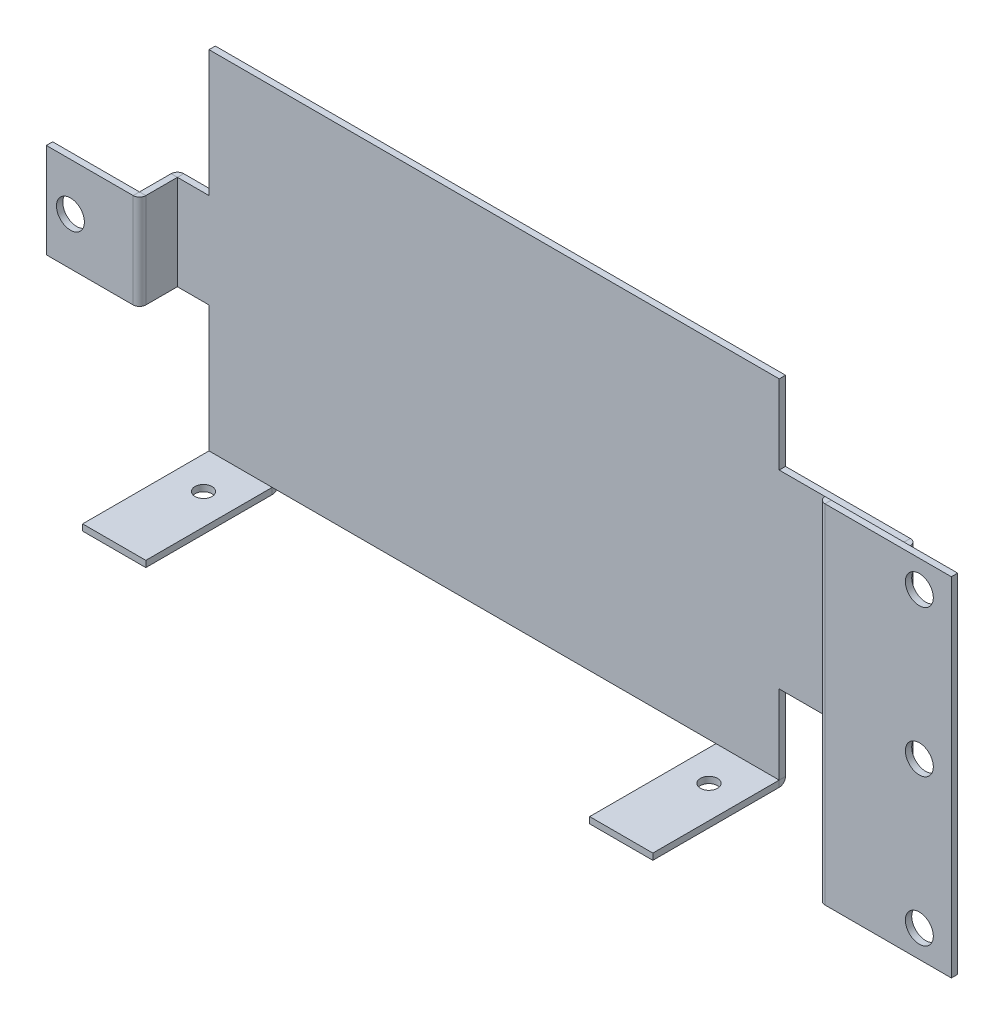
ISO-10303-21;
HEADER;
FILE_DESCRIPTION(('STEP AP214'),'2;1');
FILE_NAME('part.step','',(''),(''),'','','');
FILE_SCHEMA(('AUTOMOTIVE_DESIGN { 1 0 10303 214 1 1 1 1 }'));
ENDSEC;
DATA;
#1=APPLICATION_CONTEXT('core data for automotive mechanical design processes');
#2=APPLICATION_PROTOCOL_DEFINITION('international standard','automotive_design',2000,#1);
#3=PRODUCT_CONTEXT('',#1,'mechanical');
#4=PRODUCT('Part','Part','',(#3));
#5=PRODUCT_RELATED_PRODUCT_CATEGORY('part','',(#4));
#6=PRODUCT_DEFINITION_FORMATION('','',#4);
#7=PRODUCT_DEFINITION_CONTEXT('part definition',#1,'design');
#8=PRODUCT_DEFINITION('design','',#6,#7);
#9=PRODUCT_DEFINITION_SHAPE('','',#8);
#10=(LENGTH_UNIT() NAMED_UNIT(*) SI_UNIT(.MILLI.,.METRE.));
#11=(NAMED_UNIT(*) PLANE_ANGLE_UNIT() SI_UNIT($,.RADIAN.));
#12=(NAMED_UNIT(*) SI_UNIT($,.STERADIAN.) SOLID_ANGLE_UNIT());
#13=UNCERTAINTY_MEASURE_WITH_UNIT(LENGTH_MEASURE(1.E-05),#10,'distance_accuracy_value','');
#14=(GEOMETRIC_REPRESENTATION_CONTEXT(3) GLOBAL_UNCERTAINTY_ASSIGNED_CONTEXT((#13)) GLOBAL_UNIT_ASSIGNED_CONTEXT((#10,
#11,#12)) REPRESENTATION_CONTEXT('',''));
#15=CARTESIAN_POINT('',(0.,0.,0.));
#16=DIRECTION('',(0.,0.,1.));
#17=DIRECTION('',(1.,0.,0.));
#18=AXIS2_PLACEMENT_3D('',#15,#16,#17);
#19=CARTESIAN_POINT('',(-69.85,-34.925,1.27000000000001));
#20=DIRECTION('',(-1.,0.,0.));
#21=DIRECTION('',(0.,0.,1.));
#22=AXIS2_PLACEMENT_3D('',#19,#20,#21);
#23=CYLINDRICAL_SURFACE('',#22,1.27000000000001);
#24=DIRECTION('',(1.,0.,0.));
#25=VECTOR('',#24,1.);
#26=CARTESIAN_POINT('',(-76.2,-34.925,0.));
#27=LINE('',#26,#25);
#28=CARTESIAN_POINT('',(-69.85,-34.925,0.));
#29=VERTEX_POINT('',#28);
#30=CARTESIAN_POINT('',(-57.15,-34.9250000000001,0.));
#31=VERTEX_POINT('',#30);
#32=EDGE_CURVE('E260',#29,#31,#27,.T.);
#33=ORIENTED_EDGE('',*,*,#32,.T.);
#34=CARTESIAN_POINT('',(-57.15,-34.925,1.27));
#35=DIRECTION('',(-1.,0.,0.));
#36=DIRECTION('',(0.,-1.,0.));
#37=AXIS2_PLACEMENT_3D('',#34,#35,#36);
#38=CIRCLE('',#37,1.27000000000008);
#39=CARTESIAN_POINT('',(-57.15,-36.1950000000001,1.27));
#40=VERTEX_POINT('',#39);
#41=EDGE_CURVE('E249',#31,#40,#38,.T.);
#42=ORIENTED_EDGE('',*,*,#41,.T.);
#43=DIRECTION('',(1.,0.,0.));
#44=VECTOR('',#43,1.);
#45=CARTESIAN_POINT('',(-69.85,-36.195,1.27));
#46=LINE('',#45,#44);
#47=CARTESIAN_POINT('',(-69.85,-36.195,1.27));
#48=VERTEX_POINT('',#47);
#49=EDGE_CURVE('E257',#48,#40,#46,.T.);
#50=ORIENTED_EDGE('',*,*,#49,.F.);
#51=CARTESIAN_POINT('',(-69.85,-34.925,1.27000000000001));
#52=DIRECTION('',(-1.,0.,0.));
#53=DIRECTION('',(0.,0.,1.));
#54=AXIS2_PLACEMENT_3D('',#51,#52,#53);
#55=CIRCLE('',#54,1.27000000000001);
#56=EDGE_CURVE('E35',#29,#48,#55,.T.);
#57=ORIENTED_EDGE('',*,*,#56,.F.);
#58=EDGE_LOOP('',(#33,#42,#50,#57));
#59=FACE_BOUND('',#58,.T.);
#60=ADVANCED_FACE('F26',(#59),#23,.T.);
#61=CARTESIAN_POINT('',(-69.85,-36.1950000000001,26.67));
#62=DIRECTION('',(0.,0.,-1.));
#63=DIRECTION('',(0.,1.,0.));
#64=AXIS2_PLACEMENT_3D('',#61,#62,#63);
#65=PLANE('',#64);
#66=DIRECTION('',(0.,-1.,0.));
#67=VECTOR('',#66,1.);
#68=CARTESIAN_POINT('',(32.0675,-36.1950000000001,26.6700000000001));
#69=LINE('',#68,#67);
#70=CARTESIAN_POINT('',(32.0675,-36.1950000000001,26.6700000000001));
#71=VERTEX_POINT('',#70);
#72=CARTESIAN_POINT('',(32.0675,-34.9250000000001,26.6700000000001));
#73=VERTEX_POINT('',#72);
#74=EDGE_CURVE('E578',#71,#73,#69,.F.);
#75=ORIENTED_EDGE('',*,*,#74,.F.);
#76=DIRECTION('',(-1.,0.,0.));
#77=VECTOR('',#76,1.);
#78=CARTESIAN_POINT('',(-69.85,-36.1950000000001,26.67));
#79=LINE('',#78,#77);
#80=CARTESIAN_POINT('',(44.7675,-36.1950000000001,26.67));
#81=VERTEX_POINT('',#80);
#82=EDGE_CURVE('E275',#81,#71,#79,.T.);
#83=ORIENTED_EDGE('',*,*,#82,.F.);
#84=DIRECTION('',(0.,1.,0.));
#85=VECTOR('',#84,1.);
#86=CARTESIAN_POINT('',(44.7675,-36.1950000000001,26.67));
#87=LINE('',#86,#85);
#88=CARTESIAN_POINT('',(44.7675,-34.9250000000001,26.67));
#89=VERTEX_POINT('',#88);
#90=EDGE_CURVE('E281',#81,#89,#87,.T.);
#91=ORIENTED_EDGE('',*,*,#90,.T.);
#92=DIRECTION('',(-1.,0.,0.));
#93=VECTOR('',#92,1.);
#94=CARTESIAN_POINT('',(-69.85,-34.9250000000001,26.67));
#95=LINE('',#94,#93);
#96=EDGE_CURVE('E588',#89,#73,#95,.T.);
#97=ORIENTED_EDGE('',*,*,#96,.T.);
#98=EDGE_LOOP('',(#75,#83,#91,#97));
#99=FACE_BOUND('',#98,.T.);
#100=ADVANCED_FACE('F737',(#99),#65,.F.);
#101=DIRECTION('',(0.,-1.,0.));
#102=VECTOR('',#101,1.);
#103=CARTESIAN_POINT('',(-57.15,-36.1950000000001,26.6700000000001));
#104=LINE('',#103,#102);
#105=CARTESIAN_POINT('',(-57.15,-36.1950000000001,26.6700000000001));
#106=VERTEX_POINT('',#105);
#107=CARTESIAN_POINT('',(-57.15,-34.9250000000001,26.6700000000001));
#108=VERTEX_POINT('',#107);
#109=EDGE_CURVE('E244',#106,#108,#104,.F.);
#110=ORIENTED_EDGE('',*,*,#109,.T.);
#111=CARTESIAN_POINT('',(-69.85,-34.9250000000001,26.67));
#112=VERTEX_POINT('',#111);
#113=EDGE_CURVE('E587',#108,#112,#95,.T.);
#114=ORIENTED_EDGE('',*,*,#113,.T.);
#115=DIRECTION('',(0.,1.,0.));
#116=VECTOR('',#115,1.);
#117=CARTESIAN_POINT('',(-69.85,-36.1950000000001,26.67));
#118=LINE('',#117,#116);
#119=CARTESIAN_POINT('',(-69.85,-36.1950000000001,26.67));
#120=VERTEX_POINT('',#119);
#121=EDGE_CURVE('E278',#120,#112,#118,.T.);
#122=ORIENTED_EDGE('',*,*,#121,.F.);
#123=EDGE_CURVE('E270',#106,#120,#79,.T.);
#124=ORIENTED_EDGE('',*,*,#123,.F.);
#125=EDGE_LOOP('',(#110,#114,#122,#124));
#126=FACE_BOUND('',#125,.T.);
#127=ADVANCED_FACE('F596',(#126),#65,.F.);
#128=CARTESIAN_POINT('',(-69.85,-36.1950000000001,26.67));
#129=DIRECTION('',(0.,1.,0.));
#130=DIRECTION('',(0.,0.,1.));
#131=AXIS2_PLACEMENT_3D('',#128,#129,#130);
#132=PLANE('',#131);
#133=CARTESIAN_POINT('',(38.2651,-36.195,8.89));
#134=DIRECTION('',(0.,-1.,0.));
#135=DIRECTION('',(0.,0.,-1.));
#136=AXIS2_PLACEMENT_3D('',#133,#134,#135);
#137=CIRCLE('',#136,1.7272);
#138=CARTESIAN_POINT('',(38.2651,-36.195,7.16279999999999));
#139=VERTEX_POINT('',#138);
#140=EDGE_CURVE('E555',#139,#139,#137,.T.);
#141=ORIENTED_EDGE('',*,*,#140,.F.);
#142=EDGE_LOOP('',(#141));
#143=FACE_BOUND('',#142,.T.);
#144=DIRECTION('',(0.,0.,1.));
#145=VECTOR('',#144,1.);
#146=CARTESIAN_POINT('',(32.0675,-36.1950000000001,0.));
#147=LINE('',#146,#145);
#148=CARTESIAN_POINT('',(32.0675,-36.1950000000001,1.27));
#149=VERTEX_POINT('',#148);
#150=EDGE_CURVE('E248',#149,#71,#147,.T.);
#151=ORIENTED_EDGE('',*,*,#150,.F.);
#152=CARTESIAN_POINT('',(44.7675,-36.195,1.27));
#153=VERTEX_POINT('',#152);
#154=EDGE_CURVE('E268',#149,#153,#46,.T.);
#155=ORIENTED_EDGE('',*,*,#154,.T.);
#156=DIRECTION('',(0.,0.,1.));
#157=VECTOR('',#156,1.);
#158=CARTESIAN_POINT('',(44.7675,-36.1950000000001,26.67));
#159=LINE('',#158,#157);
#160=EDGE_CURVE('E267',#153,#81,#159,.T.);
#161=ORIENTED_EDGE('',*,*,#160,.T.);
#162=ORIENTED_EDGE('',*,*,#82,.T.);
#163=EDGE_LOOP('',(#151,#155,#161,#162));
#164=FACE_BOUND('',#163,.T.);
#165=ADVANCED_FACE('F780',(#143,#164),#132,.F.);
#166=CARTESIAN_POINT('',(-63.3349,-36.195,8.89));
#167=DIRECTION('',(0.,-1.,0.));
#168=DIRECTION('',(0.,0.,-1.));
#169=AXIS2_PLACEMENT_3D('',#166,#167,#168);
#170=CIRCLE('',#169,1.7272);
#171=CARTESIAN_POINT('',(-63.3349,-36.195,7.16279999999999));
#172=VERTEX_POINT('',#171);
#173=EDGE_CURVE('E564',#172,#172,#170,.T.);
#174=ORIENTED_EDGE('',*,*,#173,.F.);
#175=EDGE_LOOP('',(#174));
#176=FACE_BOUND('',#175,.T.);
#177=DIRECTION('',(0.,0.,1.));
#178=VECTOR('',#177,1.);
#179=CARTESIAN_POINT('',(-57.15,-36.1950000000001,0.));
#180=LINE('',#179,#178);
#181=EDGE_CURVE('E238',#40,#106,#180,.T.);
#182=ORIENTED_EDGE('',*,*,#181,.T.);
#183=ORIENTED_EDGE('',*,*,#123,.T.);
#184=DIRECTION('',(0.,0.,-1.));
#185=VECTOR('',#184,1.);
#186=CARTESIAN_POINT('',(-69.85,-36.195,1.27));
#187=LINE('',#186,#185);
#188=EDGE_CURVE('E265',#120,#48,#187,.T.);
#189=ORIENTED_EDGE('',*,*,#188,.T.);
#190=ORIENTED_EDGE('',*,*,#49,.T.);
#191=EDGE_LOOP('',(#182,#183,#189,#190));
#192=FACE_BOUND('',#191,.T.);
#193=ADVANCED_FACE('F263',(#176,#192),#132,.F.);
#194=CARTESIAN_POINT('',(-69.85,-34.9250000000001,26.67));
#195=DIRECTION('',(0.,1.,0.));
#196=DIRECTION('',(0.,0.,1.));
#197=AXIS2_PLACEMENT_3D('',#194,#195,#196);
#198=PLANE('',#197);
#199=CARTESIAN_POINT('',(38.2651,-34.925,8.89));
#200=DIRECTION('',(0.,1.,0.));
#201=DIRECTION('',(0.,0.,1.));
#202=AXIS2_PLACEMENT_3D('',#199,#200,#201);
#203=CIRCLE('',#202,1.7272);
#204=CARTESIAN_POINT('',(38.2651,-34.925,10.6172));
#205=VERTEX_POINT('',#204);
#206=EDGE_CURVE('E552',#205,#205,#203,.T.);
#207=ORIENTED_EDGE('',*,*,#206,.F.);
#208=EDGE_LOOP('',(#207));
#209=FACE_BOUND('',#208,.T.);
#210=DIRECTION('',(1.,0.,0.));
#211=VECTOR('',#210,1.);
#212=CARTESIAN_POINT('',(-76.2,-34.925,1.27));
#213=LINE('',#212,#211);
#214=CARTESIAN_POINT('',(32.0675,-34.925,1.27));
#215=VERTEX_POINT('',#214);
#216=CARTESIAN_POINT('',(44.7675,-34.925,1.27));
#217=VERTEX_POINT('',#216);
#218=EDGE_CURVE('E527',#215,#217,#213,.T.);
#219=ORIENTED_EDGE('',*,*,#218,.F.);
#220=DIRECTION('',(0.,0.,1.));
#221=VECTOR('',#220,1.);
#222=CARTESIAN_POINT('',(32.0675,-34.9250000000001,26.67));
#223=LINE('',#222,#221);
#224=EDGE_CURVE('E255',#215,#73,#223,.T.);
#225=ORIENTED_EDGE('',*,*,#224,.T.);
#226=ORIENTED_EDGE('',*,*,#96,.F.);
#227=DIRECTION('',(0.,0.,1.));
#228=VECTOR('',#227,1.);
#229=CARTESIAN_POINT('',(44.7675,-34.9250000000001,26.67));
#230=LINE('',#229,#228);
#231=EDGE_CURVE('E586',#217,#89,#230,.T.);
#232=ORIENTED_EDGE('',*,*,#231,.F.);
#233=EDGE_LOOP('',(#219,#225,#226,#232));
#234=FACE_BOUND('',#233,.T.);
#235=ADVANCED_FACE('F768',(#209,#234),#198,.T.);
#236=CARTESIAN_POINT('',(-63.3349,-34.925,8.89));
#237=DIRECTION('',(0.,1.,0.));
#238=DIRECTION('',(0.,0.,1.));
#239=AXIS2_PLACEMENT_3D('',#236,#237,#238);
#240=CIRCLE('',#239,1.7272);
#241=CARTESIAN_POINT('',(-63.3349,-34.925,10.6172));
#242=VERTEX_POINT('',#241);
#243=EDGE_CURVE('E30',#242,#242,#240,.T.);
#244=ORIENTED_EDGE('',*,*,#243,.F.);
#245=EDGE_LOOP('',(#244));
#246=FACE_BOUND('',#245,.T.);
#247=ORIENTED_EDGE('',*,*,#113,.F.);
#248=DIRECTION('',(0.,0.,1.));
#249=VECTOR('',#248,1.);
#250=CARTESIAN_POINT('',(-57.15,-34.9250000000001,26.67));
#251=LINE('',#250,#249);
#252=CARTESIAN_POINT('',(-57.15,-34.925,1.27));
#253=VERTEX_POINT('',#252);
#254=EDGE_CURVE('E572',#253,#108,#251,.T.);
#255=ORIENTED_EDGE('',*,*,#254,.F.);
#256=CARTESIAN_POINT('',(-69.85,-34.925,1.27000000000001));
#257=VERTEX_POINT('',#256);
#258=EDGE_CURVE('E528',#257,#253,#213,.T.);
#259=ORIENTED_EDGE('',*,*,#258,.F.);
#260=DIRECTION('',(0.,0.,-1.));
#261=VECTOR('',#260,1.);
#262=CARTESIAN_POINT('',(-69.85,-34.925,1.27000000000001));
#263=LINE('',#262,#261);
#264=EDGE_CURVE('E582',#112,#257,#263,.T.);
#265=ORIENTED_EDGE('',*,*,#264,.F.);
#266=EDGE_LOOP('',(#247,#255,#259,#265));
#267=FACE_BOUND('',#266,.T.);
#268=ADVANCED_FACE('F602',(#246,#267),#198,.T.);
#269=CARTESIAN_POINT('',(44.7675,-34.925,0.));
#270=DIRECTION('',(1.,0.,0.));
#271=DIRECTION('',(0.,0.,-1.));
#272=AXIS2_PLACEMENT_3D('',#269,#270,#271);
#273=PLANE('',#272);
#274=CARTESIAN_POINT('',(44.7675,-34.925,1.27));
#275=DIRECTION('',(-1.,0.,0.));
#276=DIRECTION('',(0.,0.,1.));
#277=AXIS2_PLACEMENT_3D('',#274,#275,#276);
#278=CIRCLE('',#277,1.27000000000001);
#279=CARTESIAN_POINT('',(44.7675,-34.925,0.));
#280=VERTEX_POINT('',#279);
#281=EDGE_CURVE('E11',#280,#153,#278,.T.);
#282=ORIENTED_EDGE('',*,*,#281,.F.);
#283=DIRECTION('',(0.,0.,1.));
#284=VECTOR('',#283,1.);
#285=CARTESIAN_POINT('',(44.7675,-34.925,1.27));
#286=LINE('',#285,#284);
#287=EDGE_CURVE('E343',#217,#280,#286,.F.);
#288=ORIENTED_EDGE('',*,*,#287,.F.);
#289=DIRECTION('',(0.,1.,0.));
#290=VECTOR('',#289,1.);
#291=CARTESIAN_POINT('',(44.7675,-36.195,1.27));
#292=LINE('',#291,#290);
#293=EDGE_CURVE('E284',#153,#217,#292,.T.);
#294=ORIENTED_EDGE('',*,*,#293,.F.);
#295=EDGE_LOOP('',(#282,#288,#294));
#296=FACE_BOUND('',#295,.T.);
#297=ADVANCED_FACE('F28',(#296),#273,.T.);
#298=CARTESIAN_POINT('',(32.0675,-34.925,1.27));
#299=DIRECTION('',(-1.,0.,0.));
#300=DIRECTION('',(0.,-1.,0.));
#301=AXIS2_PLACEMENT_3D('',#298,#299,#300);
#302=CIRCLE('',#301,1.27000000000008);
#303=CARTESIAN_POINT('',(32.0675,-34.9250000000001,0.));
#304=VERTEX_POINT('',#303);
#305=EDGE_CURVE('E261',#304,#149,#302,.T.);
#306=ORIENTED_EDGE('',*,*,#305,.F.);
#307=EDGE_CURVE('E516',#304,#280,#27,.T.);
#308=ORIENTED_EDGE('',*,*,#307,.T.);
#309=ORIENTED_EDGE('',*,*,#281,.T.);
#310=ORIENTED_EDGE('',*,*,#154,.F.);
#311=EDGE_LOOP('',(#306,#308,#309,#310));
#312=FACE_BOUND('',#311,.T.);
#313=ADVANCED_FACE('F738',(#312),#23,.T.);
#314=CARTESIAN_POINT('',(-69.85,-34.925,0.));
#315=DIRECTION('',(1.,0.,0.));
#316=DIRECTION('',(0.,0.,-1.));
#317=AXIS2_PLACEMENT_3D('',#314,#315,#316);
#318=PLANE('',#317);
#319=DIRECTION('',(0.,0.,1.));
#320=VECTOR('',#319,1.);
#321=CARTESIAN_POINT('',(-69.85,-34.925,1.27000000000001));
#322=LINE('',#321,#320);
#323=EDGE_CURVE('E386',#257,#29,#322,.F.);
#324=ORIENTED_EDGE('',*,*,#323,.T.);
#325=ORIENTED_EDGE('',*,*,#56,.T.);
#326=DIRECTION('',(0.,1.,0.));
#327=VECTOR('',#326,1.);
#328=CARTESIAN_POINT('',(-69.85,-36.195,1.27));
#329=LINE('',#328,#327);
#330=EDGE_CURVE('E287',#48,#257,#329,.T.);
#331=ORIENTED_EDGE('',*,*,#330,.T.);
#332=EDGE_LOOP('',(#324,#325,#331));
#333=FACE_BOUND('',#332,.T.);
#334=ADVANCED_FACE('F745',(#333),#318,.F.);
#335=CARTESIAN_POINT('',(69.85,-34.925,1.27));
#336=DIRECTION('',(0.,0.,-1.));
#337=DIRECTION('',(-1.,0.,0.));
#338=AXIS2_PLACEMENT_3D('',#335,#336,#337);
#339=PLANE('',#338);
#340=DIRECTION('',(0.,1.,0.));
#341=VECTOR('',#340,1.);
#342=CARTESIAN_POINT('',(69.85,34.925,1.27));
#343=LINE('',#342,#341);
#344=CARTESIAN_POINT('',(69.85,-19.05,1.27000000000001));
#345=VERTEX_POINT('',#344);
#346=CARTESIAN_POINT('',(69.85,19.05,1.27));
#347=VERTEX_POINT('',#346);
#348=EDGE_CURVE('E531',#345,#347,#343,.T.);
#349=ORIENTED_EDGE('',*,*,#348,.T.);
#350=DIRECTION('',(1.,0.,0.));
#351=VECTOR('',#350,1.);
#352=CARTESIAN_POINT('',(69.85,19.05,1.27));
#353=LINE('',#352,#351);
#354=CARTESIAN_POINT('',(44.7675,19.05,1.27000000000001));
#355=VERTEX_POINT('',#354);
#356=EDGE_CURVE('E446',#355,#347,#353,.T.);
#357=ORIENTED_EDGE('',*,*,#356,.F.);
#358=DIRECTION('',(0.,-1.,0.));
#359=VECTOR('',#358,1.);
#360=CARTESIAN_POINT('',(44.7675,-34.925,1.27));
#361=LINE('',#360,#359);
#362=CARTESIAN_POINT('',(44.7675,34.925,1.27000000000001));
#363=VERTEX_POINT('',#362);
#364=EDGE_CURVE('E442',#363,#355,#361,.T.);
#365=ORIENTED_EDGE('',*,*,#364,.F.);
#366=DIRECTION('',(-1.,0.,0.));
#367=VECTOR('',#366,1.);
#368=CARTESIAN_POINT('',(-76.2,34.925,1.27));
#369=LINE('',#368,#367);
#370=CARTESIAN_POINT('',(-69.85,34.925,1.27000000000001));
#371=VERTEX_POINT('',#370);
#372=EDGE_CURVE('E534',#363,#371,#369,.T.);
#373=ORIENTED_EDGE('',*,*,#372,.T.);
#374=DIRECTION('',(0.,1.,0.));
#375=VECTOR('',#374,1.);
#376=CARTESIAN_POINT('',(-69.85,-34.925,1.27));
#377=LINE('',#376,#375);
#378=CARTESIAN_POINT('',(-69.85,9.52499999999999,1.27000000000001));
#379=VERTEX_POINT('',#378);
#380=EDGE_CURVE('E428',#379,#371,#377,.T.);
#381=ORIENTED_EDGE('',*,*,#380,.F.);
#382=DIRECTION('',(1.,0.,0.));
#383=VECTOR('',#382,1.);
#384=CARTESIAN_POINT('',(69.85,9.52499999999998,1.27));
#385=LINE('',#384,#383);
#386=CARTESIAN_POINT('',(-76.2,9.52499999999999,1.27));
#387=VERTEX_POINT('',#386);
#388=EDGE_CURVE('E424',#387,#379,#385,.T.);
#389=ORIENTED_EDGE('',*,*,#388,.F.);
#390=DIRECTION('',(0.,-1.,0.));
#391=VECTOR('',#390,1.);
#392=CARTESIAN_POINT('',(-76.2,34.925,1.27));
#393=LINE('',#392,#391);
#394=CARTESIAN_POINT('',(-76.2,-9.52499999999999,1.27000000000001));
#395=VERTEX_POINT('',#394);
#396=EDGE_CURVE('E537',#387,#395,#393,.T.);
#397=ORIENTED_EDGE('',*,*,#396,.T.);
#398=DIRECTION('',(-1.,0.,0.));
#399=VECTOR('',#398,1.);
#400=CARTESIAN_POINT('',(69.85,-9.52499999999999,1.27));
#401=LINE('',#400,#399);
#402=CARTESIAN_POINT('',(-69.85,-9.52499999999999,1.27000000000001));
#403=VERTEX_POINT('',#402);
#404=EDGE_CURVE('E379',#403,#395,#401,.T.);
#405=ORIENTED_EDGE('',*,*,#404,.F.);
#406=DIRECTION('',(0.,1.,0.));
#407=VECTOR('',#406,1.);
#408=CARTESIAN_POINT('',(-69.85,-34.925,1.27));
#409=LINE('',#408,#407);
#410=EDGE_CURVE('E375',#257,#403,#409,.T.);
#411=ORIENTED_EDGE('',*,*,#410,.F.);
#412=ORIENTED_EDGE('',*,*,#258,.T.);
#413=DIRECTION('',(1.,0.,0.));
#414=VECTOR('',#413,1.);
#415=CARTESIAN_POINT('',(-69.85,-34.925,1.27));
#416=LINE('',#415,#414);
#417=EDGE_CURVE('E43',#253,#215,#416,.T.);
#418=ORIENTED_EDGE('',*,*,#417,.T.);
#419=ORIENTED_EDGE('',*,*,#218,.T.);
#420=DIRECTION('',(0.,-1.,0.));
#421=VECTOR('',#420,1.);
#422=CARTESIAN_POINT('',(44.7675,-34.925,1.27));
#423=LINE('',#422,#421);
#424=CARTESIAN_POINT('',(44.7675,-19.05,1.27000000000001));
#425=VERTEX_POINT('',#424);
#426=EDGE_CURVE('E336',#425,#217,#423,.T.);
#427=ORIENTED_EDGE('',*,*,#426,.F.);
#428=DIRECTION('',(-1.,0.,0.));
#429=VECTOR('',#428,1.);
#430=CARTESIAN_POINT('',(69.85,-19.05,1.27));
#431=LINE('',#430,#429);
#432=EDGE_CURVE('E333',#345,#425,#431,.T.);
#433=ORIENTED_EDGE('',*,*,#432,.F.);
#434=EDGE_LOOP('',(#349,#357,#365,#373,#381,#389,#397,#405,#411,#412,#418,#419,#427,#433));
#435=FACE_BOUND('',#434,.T.);
#436=ADVANCED_FACE('F605',(#435),#339,.F.);
#437=CARTESIAN_POINT('',(69.85,-34.925,0.));
#438=DIRECTION('',(0.,0.,-1.));
#439=DIRECTION('',(-1.,0.,0.));
#440=AXIS2_PLACEMENT_3D('',#437,#438,#439);
#441=PLANE('',#440);
#442=DIRECTION('',(-1.,0.,0.));
#443=VECTOR('',#442,1.);
#444=CARTESIAN_POINT('',(69.85,19.05,0.));
#445=LINE('',#444,#443);
#446=CARTESIAN_POINT('',(44.7675,19.05,0.));
#447=VERTEX_POINT('',#446);
#448=CARTESIAN_POINT('',(69.85,19.05,0.));
#449=VERTEX_POINT('',#448);
#450=EDGE_CURVE('E449',#447,#449,#445,.F.);
#451=ORIENTED_EDGE('',*,*,#450,.T.);
#452=DIRECTION('',(0.,1.,0.));
#453=VECTOR('',#452,1.);
#454=CARTESIAN_POINT('',(69.85,34.925,0.));
#455=LINE('',#454,#453);
#456=CARTESIAN_POINT('',(69.85,-19.05,0.));
#457=VERTEX_POINT('',#456);
#458=EDGE_CURVE('E518',#457,#449,#455,.T.);
#459=ORIENTED_EDGE('',*,*,#458,.F.);
#460=DIRECTION('',(-1.,0.,0.));
#461=VECTOR('',#460,1.);
#462=CARTESIAN_POINT('',(69.85,-19.05,0.));
#463=LINE('',#462,#461);
#464=CARTESIAN_POINT('',(44.7675,-19.05,0.));
#465=VERTEX_POINT('',#464);
#466=EDGE_CURVE('E339',#457,#465,#463,.T.);
#467=ORIENTED_EDGE('',*,*,#466,.T.);
#468=DIRECTION('',(0.,1.,0.));
#469=VECTOR('',#468,1.);
#470=CARTESIAN_POINT('',(44.7675,-34.925,0.));
#471=LINE('',#470,#469);
#472=EDGE_CURVE('E340',#465,#280,#471,.F.);
#473=ORIENTED_EDGE('',*,*,#472,.T.);
#474=ORIENTED_EDGE('',*,*,#307,.F.);
#475=DIRECTION('',(1.,0.,0.));
#476=VECTOR('',#475,1.);
#477=CARTESIAN_POINT('',(-69.85,-34.9250000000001,0.));
#478=LINE('',#477,#476);
#479=EDGE_CURVE('E554',#31,#304,#478,.T.);
#480=ORIENTED_EDGE('',*,*,#479,.F.);
#481=ORIENTED_EDGE('',*,*,#32,.F.);
#482=DIRECTION('',(0.,1.,0.));
#483=VECTOR('',#482,1.);
#484=CARTESIAN_POINT('',(-69.85,-34.925,0.));
#485=LINE('',#484,#483);
#486=CARTESIAN_POINT('',(-69.85,-9.52499999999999,0.));
#487=VERTEX_POINT('',#486);
#488=EDGE_CURVE('E382',#29,#487,#485,.T.);
#489=ORIENTED_EDGE('',*,*,#488,.T.);
#490=DIRECTION('',(-1.,0.,0.));
#491=VECTOR('',#490,1.);
#492=CARTESIAN_POINT('',(69.85,-9.52499999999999,0.));
#493=LINE('',#492,#491);
#494=CARTESIAN_POINT('',(-76.2,-9.52499999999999,0.));
#495=VERTEX_POINT('',#494);
#496=EDGE_CURVE('E383',#487,#495,#493,.T.);
#497=ORIENTED_EDGE('',*,*,#496,.T.);
#498=DIRECTION('',(0.,-1.,0.));
#499=VECTOR('',#498,1.);
#500=CARTESIAN_POINT('',(-76.2,34.925,0.));
#501=LINE('',#500,#499);
#502=CARTESIAN_POINT('',(-76.2,9.52499999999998,0.));
#503=VERTEX_POINT('',#502);
#504=EDGE_CURVE('E524',#503,#495,#501,.T.);
#505=ORIENTED_EDGE('',*,*,#504,.F.);
#506=DIRECTION('',(-1.,0.,0.));
#507=VECTOR('',#506,1.);
#508=CARTESIAN_POINT('',(69.85,9.52499999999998,0.));
#509=LINE('',#508,#507);
#510=CARTESIAN_POINT('',(-69.85,9.52499999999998,0.));
#511=VERTEX_POINT('',#510);
#512=EDGE_CURVE('E430',#503,#511,#509,.F.);
#513=ORIENTED_EDGE('',*,*,#512,.T.);
#514=DIRECTION('',(0.,1.,0.));
#515=VECTOR('',#514,1.);
#516=CARTESIAN_POINT('',(-69.85,-34.925,0.));
#517=LINE('',#516,#515);
#518=CARTESIAN_POINT('',(-69.85,34.925,0.));
#519=VERTEX_POINT('',#518);
#520=EDGE_CURVE('E433',#511,#519,#517,.T.);
#521=ORIENTED_EDGE('',*,*,#520,.T.);
#522=DIRECTION('',(-1.,0.,0.));
#523=VECTOR('',#522,1.);
#524=CARTESIAN_POINT('',(-76.2,34.925,0.));
#525=LINE('',#524,#523);
#526=CARTESIAN_POINT('',(44.7675,34.925,0.));
#527=VERTEX_POINT('',#526);
#528=EDGE_CURVE('E521',#527,#519,#525,.T.);
#529=ORIENTED_EDGE('',*,*,#528,.F.);
#530=DIRECTION('',(0.,1.,0.));
#531=VECTOR('',#530,1.);
#532=CARTESIAN_POINT('',(44.7675,-34.925,0.));
#533=LINE('',#532,#531);
#534=EDGE_CURVE('E448',#527,#447,#533,.F.);
#535=ORIENTED_EDGE('',*,*,#534,.T.);
#536=EDGE_LOOP('',(#451,#459,#467,#473,#474,#480,#481,#489,#497,#505,#513,#521,#529,#535));
#537=FACE_BOUND('',#536,.T.);
#538=ADVANCED_FACE('F617',(#537),#441,.T.);
#539=CARTESIAN_POINT('',(71.1200000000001,-34.925,17.145));
#540=DIRECTION('',(-1.,0.,0.));
#541=DIRECTION('',(0.,0.,1.));
#542=AXIS2_PLACEMENT_3D('',#539,#540,#541);
#543=PLANE('',#542);
#544=DIRECTION('',(0.,0.707106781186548,0.707106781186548));
#545=VECTOR('',#544,1.);
#546=CARTESIAN_POINT('',(71.1199999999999,0.,-17.78));
#547=LINE('',#546,#545);
#548=CARTESIAN_POINT('',(71.12,19.05,1.27000000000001));
#549=VERTEX_POINT('',#548);
#550=CARTESIAN_POINT('',(71.1200000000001,34.925,17.145));
#551=VERTEX_POINT('',#550);
#552=EDGE_CURVE('E292',#549,#551,#547,.T.);
#553=ORIENTED_EDGE('',*,*,#552,.T.);
#554=DIRECTION('',(0.,-1.,0.));
#555=VECTOR('',#554,1.);
#556=CARTESIAN_POINT('',(71.1200000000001,-34.925,17.145));
#557=LINE('',#556,#555);
#558=CARTESIAN_POINT('',(71.1200000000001,-34.925,17.145));
#559=VERTEX_POINT('',#558);
#560=EDGE_CURVE('E508',#551,#559,#557,.T.);
#561=ORIENTED_EDGE('',*,*,#560,.T.);
#562=DIRECTION('',(0.,0.707106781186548,-0.707106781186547));
#563=VECTOR('',#562,1.);
#564=CARTESIAN_POINT('',(71.1200000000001,-34.925,17.145));
#565=LINE('',#564,#563);
#566=CARTESIAN_POINT('',(71.12,-19.05,1.27000000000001));
#567=VERTEX_POINT('',#566);
#568=EDGE_CURVE('E306',#559,#567,#565,.T.);
#569=ORIENTED_EDGE('',*,*,#568,.T.);
#570=DIRECTION('',(0.,1.,0.));
#571=VECTOR('',#570,1.);
#572=CARTESIAN_POINT('',(71.12,-34.925,1.27));
#573=LINE('',#572,#571);
#574=EDGE_CURVE('E505',#567,#549,#573,.T.);
#575=ORIENTED_EDGE('',*,*,#574,.T.);
#576=EDGE_LOOP('',(#553,#561,#569,#575));
#577=FACE_BOUND('',#576,.T.);
#578=ADVANCED_FACE('F689',(#577),#543,.F.);
#579=CARTESIAN_POINT('',(69.8500000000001,-34.925,17.145));
#580=DIRECTION('',(-1.,0.,0.));
#581=DIRECTION('',(0.,0.,1.));
#582=AXIS2_PLACEMENT_3D('',#579,#580,#581);
#583=PLANE('',#582);
#584=DIRECTION('',(0.,-1.,0.));
#585=VECTOR('',#584,1.);
#586=CARTESIAN_POINT('',(69.8500000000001,-34.925,17.145));
#587=LINE('',#586,#585);
#588=CARTESIAN_POINT('',(69.8500000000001,34.925,17.145));
#589=VERTEX_POINT('',#588);
#590=CARTESIAN_POINT('',(69.8500000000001,-34.925,17.145));
#591=VERTEX_POINT('',#590);
#592=EDGE_CURVE('E502',#589,#591,#587,.T.);
#593=ORIENTED_EDGE('',*,*,#592,.F.);
#594=DIRECTION('',(0.,0.707106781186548,0.707106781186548));
#595=VECTOR('',#594,1.);
#596=CARTESIAN_POINT('',(69.8499999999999,0.,-17.78));
#597=LINE('',#596,#595);
#598=EDGE_CURVE('E295',#347,#589,#597,.T.);
#599=ORIENTED_EDGE('',*,*,#598,.F.);
#600=ORIENTED_EDGE('',*,*,#348,.F.);
#601=DIRECTION('',(0.,0.707106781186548,-0.707106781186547));
#602=VECTOR('',#601,1.);
#603=CARTESIAN_POINT('',(69.8500000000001,-34.925,17.145));
#604=LINE('',#603,#602);
#605=EDGE_CURVE('E309',#591,#345,#604,.T.);
#606=ORIENTED_EDGE('',*,*,#605,.F.);
#607=EDGE_LOOP('',(#593,#599,#600,#606));
#608=FACE_BOUND('',#607,.T.);
#609=ADVANCED_FACE('F678',(#608),#583,.T.);
#610=CARTESIAN_POINT('',(71.1200000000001,-34.925,18.415));
#611=DIRECTION('',(0.,0.,-1.));
#612=DIRECTION('',(-1.,0.,0.));
#613=AXIS2_PLACEMENT_3D('',#610,#611,#612);
#614=PLANE('',#613);
#615=CARTESIAN_POINT('',(90.0811,-3.05311331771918E-13,18.415));
#616=DIRECTION('',(0.,0.,1.));
#617=DIRECTION('',(-1.,0.,0.));
#618=AXIS2_PLACEMENT_3D('',#615,#616,#617);
#619=CIRCLE('',#618,2.80669999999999);
#620=CARTESIAN_POINT('',(87.2744,-3.05311331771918E-13,18.415));
#621=VERTEX_POINT('',#620);
#622=EDGE_CURVE('E322',#621,#621,#619,.T.);
#623=ORIENTED_EDGE('',*,*,#622,.F.);
#624=EDGE_LOOP('',(#623));
#625=FACE_BOUND('',#624,.T.);
#626=DIRECTION('',(0.,-1.,0.));
#627=VECTOR('',#626,1.);
#628=CARTESIAN_POINT('',(71.1200000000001,34.925,18.415));
#629=LINE('',#628,#627);
#630=CARTESIAN_POINT('',(71.1200000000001,34.925,18.415));
#631=VERTEX_POINT('',#630);
#632=CARTESIAN_POINT('',(71.1200000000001,-34.925,18.415));
#633=VERTEX_POINT('',#632);
#634=EDGE_CURVE('E480',#631,#633,#629,.T.);
#635=ORIENTED_EDGE('',*,*,#634,.T.);
#636=DIRECTION('',(1.,0.,0.));
#637=VECTOR('',#636,1.);
#638=CARTESIAN_POINT('',(96.5200000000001,-34.925,18.415));
#639=LINE('',#638,#637);
#640=CARTESIAN_POINT('',(96.5200000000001,-34.925,18.415));
#641=VERTEX_POINT('',#640);
#642=EDGE_CURVE('E483',#633,#641,#639,.T.);
#643=ORIENTED_EDGE('',*,*,#642,.T.);
#644=DIRECTION('',(0.,1.,0.));
#645=VECTOR('',#644,1.);
#646=CARTESIAN_POINT('',(96.5200000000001,34.925,18.415));
#647=LINE('',#646,#645);
#648=CARTESIAN_POINT('',(96.5200000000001,34.925,18.415));
#649=VERTEX_POINT('',#648);
#650=EDGE_CURVE('E485',#641,#649,#647,.T.);
#651=ORIENTED_EDGE('',*,*,#650,.T.);
#652=DIRECTION('',(-1.,0.,0.));
#653=VECTOR('',#652,1.);
#654=CARTESIAN_POINT('',(71.1200000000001,34.925,18.415));
#655=LINE('',#654,#653);
#656=EDGE_CURVE('E487',#649,#631,#655,.T.);
#657=ORIENTED_EDGE('',*,*,#656,.T.);
#658=EDGE_LOOP('',(#635,#643,#651,#657));
#659=FACE_BOUND('',#658,.T.);
#660=CARTESIAN_POINT('',(90.0810999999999,-29.4640000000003,18.415));
#661=DIRECTION('',(0.,0.,1.));
#662=DIRECTION('',(-1.,0.,0.));
#663=AXIS2_PLACEMENT_3D('',#660,#661,#662);
#664=CIRCLE('',#663,2.80669999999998);
#665=CARTESIAN_POINT('',(87.2743999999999,-29.4640000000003,18.415));
#666=VERTEX_POINT('',#665);
#667=EDGE_CURVE('E326',#666,#666,#664,.T.);
#668=ORIENTED_EDGE('',*,*,#667,.F.);
#669=EDGE_LOOP('',(#668));
#670=FACE_BOUND('',#669,.T.);
#671=CARTESIAN_POINT('',(90.0811000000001,29.4639999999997,18.415));
#672=DIRECTION('',(0.,0.,1.));
#673=DIRECTION('',(-1.,0.,0.));
#674=AXIS2_PLACEMENT_3D('',#671,#672,#673);
#675=CIRCLE('',#674,2.80669999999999);
#676=CARTESIAN_POINT('',(87.2744000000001,29.4639999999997,18.415));
#677=VERTEX_POINT('',#676);
#678=EDGE_CURVE('E318',#677,#677,#675,.T.);
#679=ORIENTED_EDGE('',*,*,#678,.F.);
#680=EDGE_LOOP('',(#679));
#681=FACE_BOUND('',#680,.T.);
#682=ADVANCED_FACE('F720',(#625,#659,#670,#681),#614,.F.);
#683=CARTESIAN_POINT('',(71.1200000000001,-34.925,17.145));
#684=DIRECTION('',(0.,0.,-1.));
#685=DIRECTION('',(-1.,0.,0.));
#686=AXIS2_PLACEMENT_3D('',#683,#684,#685);
#687=PLANE('',#686);
#688=CARTESIAN_POINT('',(90.0811,-3.05311331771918E-13,17.145));
#689=DIRECTION('',(0.,0.,-1.));
#690=DIRECTION('',(-1.,0.,0.));
#691=AXIS2_PLACEMENT_3D('',#688,#689,#690);
#692=CIRCLE('',#691,2.80669999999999);
#693=CARTESIAN_POINT('',(87.2744,-3.05311331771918E-13,17.145));
#694=VERTEX_POINT('',#693);
#695=EDGE_CURVE('E325',#694,#694,#692,.F.);
#696=ORIENTED_EDGE('',*,*,#695,.T.);
#697=EDGE_LOOP('',(#696));
#698=FACE_BOUND('',#697,.T.);
#699=ORIENTED_EDGE('',*,*,#560,.F.);
#700=DIRECTION('',(-1.,0.,0.));
#701=VECTOR('',#700,1.);
#702=CARTESIAN_POINT('',(71.1200000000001,34.925,17.145));
#703=LINE('',#702,#701);
#704=CARTESIAN_POINT('',(96.5200000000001,34.925,17.145));
#705=VERTEX_POINT('',#704);
#706=EDGE_CURVE('E477',#705,#551,#703,.T.);
#707=ORIENTED_EDGE('',*,*,#706,.F.);
#708=DIRECTION('',(0.,1.,0.));
#709=VECTOR('',#708,1.);
#710=CARTESIAN_POINT('',(96.5200000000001,34.925,17.145));
#711=LINE('',#710,#709);
#712=CARTESIAN_POINT('',(96.5200000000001,-34.925,17.145));
#713=VERTEX_POINT('',#712);
#714=EDGE_CURVE('E475',#713,#705,#711,.T.);
#715=ORIENTED_EDGE('',*,*,#714,.F.);
#716=DIRECTION('',(1.,0.,0.));
#717=VECTOR('',#716,1.);
#718=CARTESIAN_POINT('',(96.5200000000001,-34.925,17.145));
#719=LINE('',#718,#717);
#720=EDGE_CURVE('E473',#559,#713,#719,.T.);
#721=ORIENTED_EDGE('',*,*,#720,.F.);
#722=EDGE_LOOP('',(#699,#707,#715,#721));
#723=FACE_BOUND('',#722,.T.);
#724=CARTESIAN_POINT('',(90.0810999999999,-29.4640000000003,17.145));
#725=DIRECTION('',(0.,0.,-1.));
#726=DIRECTION('',(-1.,0.,0.));
#727=AXIS2_PLACEMENT_3D('',#724,#725,#726);
#728=CIRCLE('',#727,2.80669999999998);
#729=CARTESIAN_POINT('',(87.2743999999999,-29.4640000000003,17.145));
#730=VERTEX_POINT('',#729);
#731=EDGE_CURVE('E329',#730,#730,#728,.F.);
#732=ORIENTED_EDGE('',*,*,#731,.T.);
#733=EDGE_LOOP('',(#732));
#734=FACE_BOUND('',#733,.T.);
#735=CARTESIAN_POINT('',(90.0811000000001,29.4639999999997,17.145));
#736=DIRECTION('',(0.,0.,-1.));
#737=DIRECTION('',(-1.,0.,0.));
#738=AXIS2_PLACEMENT_3D('',#735,#736,#737);
#739=CIRCLE('',#738,2.80669999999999);
#740=CARTESIAN_POINT('',(87.2744000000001,29.4639999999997,17.145));
#741=VERTEX_POINT('',#740);
#742=EDGE_CURVE('E321',#741,#741,#739,.F.);
#743=ORIENTED_EDGE('',*,*,#742,.T.);
#744=EDGE_LOOP('',(#743));
#745=FACE_BOUND('',#744,.T.);
#746=ADVANCED_FACE('F712',(#698,#723,#734,#745),#687,.T.);
#747=CARTESIAN_POINT('',(-94.9325,-34.925,8.88999999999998));
#748=DIRECTION('',(0.,0.,-1.));
#749=DIRECTION('',(-1.,0.,0.));
#750=AXIS2_PLACEMENT_3D('',#747,#748,#749);
#751=PLANE('',#750);
#752=DIRECTION('',(-1.,0.,0.));
#753=VECTOR('',#752,1.);
#754=CARTESIAN_POINT('',(-94.9325,-9.52499999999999,8.88999999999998));
#755=LINE('',#754,#753);
#756=CARTESIAN_POINT('',(-77.47,-9.52499999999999,8.89));
#757=VERTEX_POINT('',#756);
#758=CARTESIAN_POINT('',(-94.9325,-9.52499999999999,8.88999999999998));
#759=VERTEX_POINT('',#758);
#760=EDGE_CURVE('E359',#757,#759,#755,.T.);
#761=ORIENTED_EDGE('',*,*,#760,.F.);
#762=DIRECTION('',(0.,1.,0.));
#763=VECTOR('',#762,1.);
#764=CARTESIAN_POINT('',(-77.47,-34.925,8.89));
#765=LINE('',#764,#763);
#766=CARTESIAN_POINT('',(-77.47,9.52499999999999,8.89));
#767=VERTEX_POINT('',#766);
#768=EDGE_CURVE('E461',#757,#767,#765,.T.);
#769=ORIENTED_EDGE('',*,*,#768,.T.);
#770=DIRECTION('',(1.,0.,0.));
#771=VECTOR('',#770,1.);
#772=CARTESIAN_POINT('',(-94.9325,9.52499999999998,8.88999999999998));
#773=LINE('',#772,#771);
#774=CARTESIAN_POINT('',(-94.9325,9.52499999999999,8.88999999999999));
#775=VERTEX_POINT('',#774);
#776=EDGE_CURVE('E402',#775,#767,#773,.T.);
#777=ORIENTED_EDGE('',*,*,#776,.F.);
#778=DIRECTION('',(0.,-1.,0.));
#779=VECTOR('',#778,1.);
#780=CARTESIAN_POINT('',(-94.9325,-34.925,8.88999999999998));
#781=LINE('',#780,#779);
#782=EDGE_CURVE('E463',#775,#759,#781,.T.);
#783=ORIENTED_EDGE('',*,*,#782,.T.);
#784=EDGE_LOOP('',(#761,#769,#777,#783));
#785=FACE_BOUND('',#784,.T.);
#786=CARTESIAN_POINT('',(-90.0811,3.33066907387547E-13,8.88999999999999));
#787=DIRECTION('',(0.,0.,-1.));
#788=DIRECTION('',(-1.,0.,0.));
#789=AXIS2_PLACEMENT_3D('',#786,#787,#788);
#790=CIRCLE('',#789,2.80669999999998);
#791=CARTESIAN_POINT('',(-92.8878,3.33066907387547E-13,8.88999999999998));
#792=VERTEX_POINT('',#791);
#793=EDGE_CURVE('E330',#792,#792,#790,.F.);
#794=ORIENTED_EDGE('',*,*,#793,.F.);
#795=EDGE_LOOP('',(#794));
#796=FACE_BOUND('',#795,.T.);
#797=ADVANCED_FACE('F867',(#785,#796),#751,.F.);
#798=CARTESIAN_POINT('',(-94.9325,-34.925,7.61999999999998));
#799=DIRECTION('',(0.,0.,-1.));
#800=DIRECTION('',(-1.,0.,0.));
#801=AXIS2_PLACEMENT_3D('',#798,#799,#800);
#802=PLANE('',#801);
#803=DIRECTION('',(0.,1.,0.));
#804=VECTOR('',#803,1.);
#805=CARTESIAN_POINT('',(-77.47,34.925,7.62));
#806=LINE('',#805,#804);
#807=CARTESIAN_POINT('',(-77.47,-9.52499999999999,7.62));
#808=VERTEX_POINT('',#807);
#809=CARTESIAN_POINT('',(-77.47,9.52499999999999,7.62));
#810=VERTEX_POINT('',#809);
#811=EDGE_CURVE('E471',#808,#810,#806,.T.);
#812=ORIENTED_EDGE('',*,*,#811,.F.);
#813=DIRECTION('',(-1.,0.,0.));
#814=VECTOR('',#813,1.);
#815=CARTESIAN_POINT('',(-94.9325,-9.52499999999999,7.61999999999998));
#816=LINE('',#815,#814);
#817=CARTESIAN_POINT('',(-94.9325,-9.52499999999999,7.61999999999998));
#818=VERTEX_POINT('',#817);
#819=EDGE_CURVE('E356',#808,#818,#816,.T.);
#820=ORIENTED_EDGE('',*,*,#819,.T.);
#821=DIRECTION('',(0.,-1.,0.));
#822=VECTOR('',#821,1.);
#823=CARTESIAN_POINT('',(-94.9325,-34.925,7.61999999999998));
#824=LINE('',#823,#822);
#825=CARTESIAN_POINT('',(-94.9325,9.52499999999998,7.61999999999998));
#826=VERTEX_POINT('',#825);
#827=EDGE_CURVE('E456',#826,#818,#824,.T.);
#828=ORIENTED_EDGE('',*,*,#827,.F.);
#829=DIRECTION('',(-1.,0.,0.));
#830=VECTOR('',#829,1.);
#831=CARTESIAN_POINT('',(-94.9325,9.52499999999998,7.61999999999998));
#832=LINE('',#831,#830);
#833=EDGE_CURVE('E405',#826,#810,#832,.F.);
#834=ORIENTED_EDGE('',*,*,#833,.T.);
#835=EDGE_LOOP('',(#812,#820,#828,#834));
#836=FACE_BOUND('',#835,.T.);
#837=CARTESIAN_POINT('',(-90.0811,3.33066907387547E-13,7.61999999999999));
#838=DIRECTION('',(0.,0.,-1.));
#839=DIRECTION('',(-1.,0.,0.));
#840=AXIS2_PLACEMENT_3D('',#837,#838,#839);
#841=CIRCLE('',#840,2.80669999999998);
#842=CARTESIAN_POINT('',(-92.8878,3.33066907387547E-13,7.61999999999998));
#843=VERTEX_POINT('',#842);
#844=EDGE_CURVE('E334',#843,#843,#841,.F.);
#845=ORIENTED_EDGE('',*,*,#844,.T.);
#846=EDGE_LOOP('',(#845));
#847=FACE_BOUND('',#846,.T.);
#848=ADVANCED_FACE('F864',(#836,#847),#802,.T.);
#849=CARTESIAN_POINT('',(-77.47,34.925,7.62));
#850=DIRECTION('',(1.,0.,0.));
#851=DIRECTION('',(0.,0.,-1.));
#852=AXIS2_PLACEMENT_3D('',#849,#850,#851);
#853=PLANE('',#852);
#854=DIRECTION('',(0.,0.,-1.));
#855=VECTOR('',#854,1.);
#856=CARTESIAN_POINT('',(-77.47,-9.52499999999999,7.62));
#857=LINE('',#856,#855);
#858=CARTESIAN_POINT('',(-77.47,-9.52499999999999,1.27000000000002));
#859=VERTEX_POINT('',#858);
#860=EDGE_CURVE('E365',#808,#859,#857,.T.);
#861=ORIENTED_EDGE('',*,*,#860,.F.);
#862=ORIENTED_EDGE('',*,*,#811,.T.);
#863=DIRECTION('',(0.,0.,-1.));
#864=VECTOR('',#863,1.);
#865=CARTESIAN_POINT('',(-77.47,9.52499999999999,7.62));
#866=LINE('',#865,#864);
#867=CARTESIAN_POINT('',(-77.47,9.52499999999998,1.27000000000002));
#868=VERTEX_POINT('',#867);
#869=EDGE_CURVE('E417',#868,#810,#866,.F.);
#870=ORIENTED_EDGE('',*,*,#869,.F.);
#871=DIRECTION('',(0.,-1.,0.));
#872=VECTOR('',#871,1.);
#873=CARTESIAN_POINT('',(-77.47,34.925,1.27));
#874=LINE('',#873,#872);
#875=EDGE_CURVE('E468',#868,#859,#874,.T.);
#876=ORIENTED_EDGE('',*,*,#875,.T.);
#877=EDGE_LOOP('',(#861,#862,#870,#876));
#878=FACE_BOUND('',#877,.T.);
#879=ADVANCED_FACE('F632',(#878),#853,.F.);
#880=CARTESIAN_POINT('',(-76.2,34.925,7.62));
#881=DIRECTION('',(1.,0.,0.));
#882=DIRECTION('',(0.,0.,-1.));
#883=AXIS2_PLACEMENT_3D('',#880,#881,#882);
#884=PLANE('',#883);
#885=DIRECTION('',(0.,1.,0.));
#886=VECTOR('',#885,1.);
#887=CARTESIAN_POINT('',(-76.2,34.925,7.62));
#888=LINE('',#887,#886);
#889=CARTESIAN_POINT('',(-76.2,-9.52499999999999,7.62));
#890=VERTEX_POINT('',#889);
#891=CARTESIAN_POINT('',(-76.2,9.52499999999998,7.62));
#892=VERTEX_POINT('',#891);
#893=EDGE_CURVE('E466',#890,#892,#888,.T.);
#894=ORIENTED_EDGE('',*,*,#893,.F.);
#895=DIRECTION('',(0.,0.,-1.));
#896=VECTOR('',#895,1.);
#897=CARTESIAN_POINT('',(-76.2,-9.52499999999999,7.62));
#898=LINE('',#897,#896);
#899=EDGE_CURVE('E369',#890,#395,#898,.T.);
#900=ORIENTED_EDGE('',*,*,#899,.T.);
#901=ORIENTED_EDGE('',*,*,#396,.F.);
#902=DIRECTION('',(0.,0.,1.));
#903=VECTOR('',#902,1.);
#904=CARTESIAN_POINT('',(-76.2,9.52499999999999,7.62));
#905=LINE('',#904,#903);
#906=EDGE_CURVE('E412',#387,#892,#905,.T.);
#907=ORIENTED_EDGE('',*,*,#906,.T.);
#908=EDGE_LOOP('',(#894,#900,#901,#907));
#909=FACE_BOUND('',#908,.T.);
#910=ADVANCED_FACE('F645',(#909),#884,.T.);
#911=CARTESIAN_POINT('',(-94.9325,-34.925,8.88999999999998));
#912=DIRECTION('',(1.,0.,0.));
#913=DIRECTION('',(0.,0.,-1.));
#914=AXIS2_PLACEMENT_3D('',#911,#912,#913);
#915=PLANE('',#914);
#916=DIRECTION('',(0.,0.,-1.));
#917=VECTOR('',#916,1.);
#918=CARTESIAN_POINT('',(-94.9325,-9.52499999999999,7.61999999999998));
#919=LINE('',#918,#917);
#920=EDGE_CURVE('E362',#818,#759,#919,.F.);
#921=ORIENTED_EDGE('',*,*,#920,.T.);
#922=ORIENTED_EDGE('',*,*,#782,.F.);
#923=DIRECTION('',(0.,0.,1.));
#924=VECTOR('',#923,1.);
#925=CARTESIAN_POINT('',(-94.9325,9.52499999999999,8.88999999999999));
#926=LINE('',#925,#924);
#927=EDGE_CURVE('E408',#775,#826,#926,.F.);
#928=ORIENTED_EDGE('',*,*,#927,.T.);
#929=ORIENTED_EDGE('',*,*,#827,.T.);
#930=EDGE_LOOP('',(#921,#922,#928,#929));
#931=FACE_BOUND('',#930,.T.);
#932=ADVANCED_FACE('F871',(#931),#915,.F.);
#933=CARTESIAN_POINT('',(-76.2,34.925,1.27));
#934=DIRECTION('',(0.,1.,0.));
#935=DIRECTION('',(0.,0.,1.));
#936=AXIS2_PLACEMENT_3D('',#933,#934,#935);
#937=CYLINDRICAL_SURFACE('',#936,1.26999999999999);
#938=ORIENTED_EDGE('',*,*,#504,.T.);
#939=CARTESIAN_POINT('',(-76.2,-9.52499999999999,1.27));
#940=DIRECTION('',(0.,-1.,0.));
#941=DIRECTION('',(0.,0.,-1.));
#942=AXIS2_PLACEMENT_3D('',#939,#940,#941);
#943=CIRCLE('',#942,1.27000000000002);
#944=EDGE_CURVE('E351',#859,#495,#943,.T.);
#945=ORIENTED_EDGE('',*,*,#944,.F.);
#946=ORIENTED_EDGE('',*,*,#875,.F.);
#947=CARTESIAN_POINT('',(-76.2,9.52499999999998,1.27));
#948=DIRECTION('',(0.,-1.,0.));
#949=DIRECTION('',(0.,0.,-1.));
#950=AXIS2_PLACEMENT_3D('',#947,#948,#949);
#951=CIRCLE('',#950,1.27000000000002);
#952=EDGE_CURVE('E395',#868,#503,#951,.T.);
#953=ORIENTED_EDGE('',*,*,#952,.T.);
#954=EDGE_LOOP('',(#938,#945,#946,#953));
#955=FACE_BOUND('',#954,.T.);
#956=ADVANCED_FACE('F620',(#955),#937,.T.);
#957=CARTESIAN_POINT('',(-76.2,34.925,1.27));
#958=DIRECTION('',(0.,-1.,0.));
#959=DIRECTION('',(1.,0.,0.));
#960=AXIS2_PLACEMENT_3D('',#957,#958,#959);
#961=PLANE('',#960);
#962=DIRECTION('',(0.,0.,1.));
#963=VECTOR('',#962,1.);
#964=CARTESIAN_POINT('',(-69.85,34.925,1.27000000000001));
#965=LINE('',#964,#963);
#966=EDGE_CURVE('E440',#371,#519,#965,.F.);
#967=ORIENTED_EDGE('',*,*,#966,.F.);
#968=ORIENTED_EDGE('',*,*,#372,.F.);
#969=DIRECTION('',(0.,0.,1.));
#970=VECTOR('',#969,1.);
#971=CARTESIAN_POINT('',(44.7675,34.925,1.27000000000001));
#972=LINE('',#971,#970);
#973=EDGE_CURVE('E451',#363,#527,#972,.F.);
#974=ORIENTED_EDGE('',*,*,#973,.T.);
#975=ORIENTED_EDGE('',*,*,#528,.T.);
#976=EDGE_LOOP('',(#967,#968,#974,#975));
#977=FACE_BOUND('',#976,.T.);
#978=ADVANCED_FACE('F656',(#977),#961,.F.);
#979=CARTESIAN_POINT('',(-77.47,-34.925,7.62));
#980=DIRECTION('',(0.,-1.,0.));
#981=DIRECTION('',(0.,0.,-1.));
#982=AXIS2_PLACEMENT_3D('',#979,#980,#981);
#983=CYLINDRICAL_SURFACE('',#982,1.26999999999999);
#984=CARTESIAN_POINT('',(-77.47,-9.52499999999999,7.62));
#985=DIRECTION('',(0.,1.,0.));
#986=DIRECTION('',(0.,0.,1.));
#987=AXIS2_PLACEMENT_3D('',#984,#985,#986);
#988=CIRCLE('',#987,1.27);
#989=EDGE_CURVE('E353',#757,#890,#988,.T.);
#990=ORIENTED_EDGE('',*,*,#989,.T.);
#991=ORIENTED_EDGE('',*,*,#893,.T.);
#992=CARTESIAN_POINT('',(-77.47,9.52499999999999,7.62));
#993=DIRECTION('',(0.,1.,0.));
#994=DIRECTION('',(0.,0.,1.));
#995=AXIS2_PLACEMENT_3D('',#992,#993,#994);
#996=CIRCLE('',#995,1.27);
#997=EDGE_CURVE('E399',#767,#892,#996,.T.);
#998=ORIENTED_EDGE('',*,*,#997,.F.);
#999=ORIENTED_EDGE('',*,*,#768,.F.);
#1000=EDGE_LOOP('',(#990,#991,#998,#999));
#1001=FACE_BOUND('',#1000,.T.);
#1002=ADVANCED_FACE('F901',(#1001),#983,.T.);
#1003=CARTESIAN_POINT('',(69.8500000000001,-34.925,17.145));
#1004=DIRECTION('',(0.,-1.,0.));
#1005=DIRECTION('',(0.,0.,-1.));
#1006=AXIS2_PLACEMENT_3D('',#1003,#1004,#1005);
#1007=PLANE('',#1006);
#1008=CARTESIAN_POINT('',(71.1200000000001,-34.925,17.145));
#1009=DIRECTION('',(0.,1.,0.));
#1010=DIRECTION('',(0.,0.,1.));
#1011=AXIS2_PLACEMENT_3D('',#1008,#1009,#1010);
#1012=CIRCLE('',#1011,1.27000000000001);
#1013=EDGE_CURVE('E542',#591,#633,#1012,.T.);
#1014=ORIENTED_EDGE('',*,*,#1013,.F.);
#1015=DIRECTION('',(-1.,0.,0.));
#1016=VECTOR('',#1015,1.);
#1017=CARTESIAN_POINT('',(71.1200000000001,-34.925,17.145));
#1018=LINE('',#1017,#1016);
#1019=EDGE_CURVE('E511',#559,#591,#1018,.T.);
#1020=ORIENTED_EDGE('',*,*,#1019,.F.);
#1021=DIRECTION('',(0.,0.,-1.));
#1022=VECTOR('',#1021,1.);
#1023=CARTESIAN_POINT('',(71.1200000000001,-34.925,18.415));
#1024=LINE('',#1023,#1022);
#1025=EDGE_CURVE('E499',#633,#559,#1024,.T.);
#1026=ORIENTED_EDGE('',*,*,#1025,.F.);
#1027=EDGE_LOOP('',(#1014,#1020,#1026));
#1028=FACE_BOUND('',#1027,.T.);
#1029=ADVANCED_FACE('F708',(#1028),#1007,.T.);
#1030=CARTESIAN_POINT('',(71.1200000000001,34.925,17.145));
#1031=DIRECTION('',(0.,1.,0.));
#1032=DIRECTION('',(0.,0.,1.));
#1033=AXIS2_PLACEMENT_3D('',#1030,#1031,#1032);
#1034=CYLINDRICAL_SURFACE('',#1033,1.27000000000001);
#1035=CARTESIAN_POINT('',(71.1200000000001,34.925,17.145));
#1036=DIRECTION('',(0.,1.,0.));
#1037=DIRECTION('',(0.,0.,1.));
#1038=AXIS2_PLACEMENT_3D('',#1035,#1036,#1037);
#1039=CIRCLE('',#1038,1.27000000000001);
#1040=EDGE_CURVE('E540',#589,#631,#1039,.T.);
#1041=ORIENTED_EDGE('',*,*,#1040,.F.);
#1042=ORIENTED_EDGE('',*,*,#592,.T.);
#1043=ORIENTED_EDGE('',*,*,#1013,.T.);
#1044=ORIENTED_EDGE('',*,*,#634,.F.);
#1045=EDGE_LOOP('',(#1041,#1042,#1043,#1044));
#1046=FACE_BOUND('',#1045,.T.);
#1047=ADVANCED_FACE('F682',(#1046),#1034,.T.);
#1048=CARTESIAN_POINT('',(69.8500000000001,34.925,17.145));
#1049=DIRECTION('',(0.,-1.,0.));
#1050=DIRECTION('',(0.,0.,-1.));
#1051=AXIS2_PLACEMENT_3D('',#1048,#1049,#1050);
#1052=PLANE('',#1051);
#1053=DIRECTION('',(-1.,0.,0.));
#1054=VECTOR('',#1053,1.);
#1055=CARTESIAN_POINT('',(71.1200000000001,34.925,17.145));
#1056=LINE('',#1055,#1054);
#1057=EDGE_CURVE('E513',#551,#589,#1056,.T.);
#1058=ORIENTED_EDGE('',*,*,#1057,.T.);
#1059=ORIENTED_EDGE('',*,*,#1040,.T.);
#1060=DIRECTION('',(0.,0.,-1.));
#1061=VECTOR('',#1060,1.);
#1062=CARTESIAN_POINT('',(71.1200000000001,34.925,18.415));
#1063=LINE('',#1062,#1061);
#1064=EDGE_CURVE('E490',#631,#551,#1063,.T.);
#1065=ORIENTED_EDGE('',*,*,#1064,.T.);
#1066=EDGE_LOOP('',(#1058,#1059,#1065));
#1067=FACE_BOUND('',#1066,.T.);
#1068=ADVANCED_FACE('F686',(#1067),#1052,.F.);
#1069=CARTESIAN_POINT('',(69.85,-34.925,1.27));
#1070=DIRECTION('',(0.,-1.,0.));
#1071=DIRECTION('',(0.,0.,-1.));
#1072=AXIS2_PLACEMENT_3D('',#1069,#1070,#1071);
#1073=CYLINDRICAL_SURFACE('',#1072,1.26999999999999);
#1074=CARTESIAN_POINT('',(69.85,19.05,1.27));
#1075=DIRECTION('',(0.,1.,0.));
#1076=DIRECTION('',(0.,0.,1.));
#1077=AXIS2_PLACEMENT_3D('',#1074,#1075,#1076);
#1078=CIRCLE('',#1077,1.26999999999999);
#1079=EDGE_CURVE('E289',#549,#449,#1078,.T.);
#1080=ORIENTED_EDGE('',*,*,#1079,.F.);
#1081=ORIENTED_EDGE('',*,*,#574,.F.);
#1082=CARTESIAN_POINT('',(69.85,-19.05,1.27000000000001));
#1083=DIRECTION('',(0.,1.,0.));
#1084=DIRECTION('',(-1.,0.,0.));
#1085=AXIS2_PLACEMENT_3D('',#1082,#1083,#1084);
#1086=CIRCLE('',#1085,1.27000000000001);
#1087=EDGE_CURVE('E303',#567,#457,#1086,.T.);
#1088=ORIENTED_EDGE('',*,*,#1087,.T.);
#1089=ORIENTED_EDGE('',*,*,#458,.T.);
#1090=EDGE_LOOP('',(#1080,#1081,#1088,#1089));
#1091=FACE_BOUND('',#1090,.T.);
#1092=ADVANCED_FACE('F694',(#1091),#1073,.T.);
#1093=CARTESIAN_POINT('',(96.5200000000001,-34.925,18.415));
#1094=DIRECTION('',(0.,1.,0.));
#1095=DIRECTION('',(0.,0.,1.));
#1096=AXIS2_PLACEMENT_3D('',#1093,#1094,#1095);
#1097=PLANE('',#1096);
#1098=ORIENTED_EDGE('',*,*,#720,.T.);
#1099=DIRECTION('',(0.,0.,-1.));
#1100=VECTOR('',#1099,1.);
#1101=CARTESIAN_POINT('',(96.5200000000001,-34.925,18.415));
#1102=LINE('',#1101,#1100);
#1103=EDGE_CURVE('E496',#641,#713,#1102,.T.);
#1104=ORIENTED_EDGE('',*,*,#1103,.F.);
#1105=ORIENTED_EDGE('',*,*,#642,.F.);
#1106=ORIENTED_EDGE('',*,*,#1025,.T.);
#1107=EDGE_LOOP('',(#1098,#1104,#1105,#1106));
#1108=FACE_BOUND('',#1107,.T.);
#1109=ADVANCED_FACE('F717',(#1108),#1097,.F.);
#1110=CARTESIAN_POINT('',(96.5200000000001,34.925,18.415));
#1111=DIRECTION('',(-1.,0.,0.));
#1112=DIRECTION('',(0.,0.,1.));
#1113=AXIS2_PLACEMENT_3D('',#1110,#1111,#1112);
#1114=PLANE('',#1113);
#1115=ORIENTED_EDGE('',*,*,#714,.T.);
#1116=DIRECTION('',(0.,0.,-1.));
#1117=VECTOR('',#1116,1.);
#1118=CARTESIAN_POINT('',(96.5200000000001,34.925,18.415));
#1119=LINE('',#1118,#1117);
#1120=EDGE_CURVE('E493',#649,#705,#1119,.T.);
#1121=ORIENTED_EDGE('',*,*,#1120,.F.);
#1122=ORIENTED_EDGE('',*,*,#650,.F.);
#1123=ORIENTED_EDGE('',*,*,#1103,.T.);
#1124=EDGE_LOOP('',(#1115,#1121,#1122,#1123));
#1125=FACE_BOUND('',#1124,.T.);
#1126=ADVANCED_FACE('F727',(#1125),#1114,.F.);
#1127=CARTESIAN_POINT('',(71.1200000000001,34.925,18.415));
#1128=DIRECTION('',(0.,-1.,0.));
#1129=DIRECTION('',(0.,0.,-1.));
#1130=AXIS2_PLACEMENT_3D('',#1127,#1128,#1129);
#1131=PLANE('',#1130);
#1132=ORIENTED_EDGE('',*,*,#706,.T.);
#1133=ORIENTED_EDGE('',*,*,#1064,.F.);
#1134=ORIENTED_EDGE('',*,*,#656,.F.);
#1135=ORIENTED_EDGE('',*,*,#1120,.T.);
#1136=EDGE_LOOP('',(#1132,#1133,#1134,#1135));
#1137=FACE_BOUND('',#1136,.T.);
#1138=ADVANCED_FACE('F725',(#1137),#1131,.F.);
#1139=CARTESIAN_POINT('',(69.85,19.05,1.27));
#1140=DIRECTION('',(0.,1.,0.));
#1141=DIRECTION('',(1.,0.,0.));
#1142=AXIS2_PLACEMENT_3D('',#1139,#1140,#1141);
#1143=PLANE('',#1142);
#1144=DIRECTION('',(0.,0.,1.));
#1145=VECTOR('',#1144,1.);
#1146=CARTESIAN_POINT('',(44.7675,19.05,1.27000000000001));
#1147=LINE('',#1146,#1145);
#1148=EDGE_CURVE('E454',#355,#447,#1147,.F.);
#1149=ORIENTED_EDGE('',*,*,#1148,.F.);
#1150=ORIENTED_EDGE('',*,*,#356,.T.);
#1151=DIRECTION('',(0.,0.,-1.));
#1152=VECTOR('',#1151,1.);
#1153=CARTESIAN_POINT('',(69.85,19.05,0.));
#1154=LINE('',#1153,#1152);
#1155=EDGE_CURVE('E300',#449,#347,#1154,.F.);
#1156=ORIENTED_EDGE('',*,*,#1155,.F.);
#1157=ORIENTED_EDGE('',*,*,#450,.F.);
#1158=EDGE_LOOP('',(#1149,#1150,#1156,#1157));
#1159=FACE_BOUND('',#1158,.T.);
#1160=ADVANCED_FACE('F666',(#1159),#1143,.T.);
#1161=CARTESIAN_POINT('',(44.7675,-34.925,1.27));
#1162=DIRECTION('',(1.,0.,0.));
#1163=DIRECTION('',(0.,-1.,0.));
#1164=AXIS2_PLACEMENT_3D('',#1161,#1162,#1163);
#1165=PLANE('',#1164);
#1166=ORIENTED_EDGE('',*,*,#364,.T.);
#1167=ORIENTED_EDGE('',*,*,#1148,.T.);
#1168=ORIENTED_EDGE('',*,*,#534,.F.);
#1169=ORIENTED_EDGE('',*,*,#973,.F.);
#1170=EDGE_LOOP('',(#1166,#1167,#1168,#1169));
#1171=FACE_BOUND('',#1170,.T.);
#1172=ADVANCED_FACE('F660',(#1171),#1165,.T.);
#1173=CARTESIAN_POINT('',(69.85,9.52499999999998,1.27));
#1174=DIRECTION('',(0.,1.,0.));
#1175=DIRECTION('',(1.,0.,0.));
#1176=AXIS2_PLACEMENT_3D('',#1173,#1174,#1175);
#1177=PLANE('',#1176);
#1178=DIRECTION('',(0.,0.,1.));
#1179=VECTOR('',#1178,1.);
#1180=CARTESIAN_POINT('',(-76.2,9.52499999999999,1.27));
#1181=LINE('',#1180,#1179);
#1182=EDGE_CURVE('E437',#387,#503,#1181,.F.);
#1183=ORIENTED_EDGE('',*,*,#1182,.F.);
#1184=ORIENTED_EDGE('',*,*,#388,.T.);
#1185=DIRECTION('',(0.,0.,1.));
#1186=VECTOR('',#1185,1.);
#1187=CARTESIAN_POINT('',(-69.85,9.52499999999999,1.27000000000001));
#1188=LINE('',#1187,#1186);
#1189=EDGE_CURVE('E436',#379,#511,#1188,.F.);
#1190=ORIENTED_EDGE('',*,*,#1189,.T.);
#1191=ORIENTED_EDGE('',*,*,#512,.F.);
#1192=EDGE_LOOP('',(#1183,#1184,#1190,#1191));
#1193=FACE_BOUND('',#1192,.T.);
#1194=ADVANCED_FACE('F650',(#1193),#1177,.T.);
#1195=CARTESIAN_POINT('',(-69.85,-34.925,1.27));
#1196=DIRECTION('',(-1.,0.,0.));
#1197=DIRECTION('',(0.,1.,0.));
#1198=AXIS2_PLACEMENT_3D('',#1195,#1196,#1197);
#1199=PLANE('',#1198);
#1200=ORIENTED_EDGE('',*,*,#380,.T.);
#1201=ORIENTED_EDGE('',*,*,#966,.T.);
#1202=ORIENTED_EDGE('',*,*,#520,.F.);
#1203=ORIENTED_EDGE('',*,*,#1189,.F.);
#1204=EDGE_LOOP('',(#1200,#1201,#1202,#1203));
#1205=FACE_BOUND('',#1204,.T.);
#1206=ADVANCED_FACE('F652',(#1205),#1199,.T.);
#1207=CARTESIAN_POINT('',(-76.2,9.52499999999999,7.62));
#1208=DIRECTION('',(0.,1.,0.));
#1209=DIRECTION('',(0.,0.,1.));
#1210=AXIS2_PLACEMENT_3D('',#1207,#1208,#1209);
#1211=PLANE('',#1210);
#1212=DIRECTION('',(1.,0.,0.));
#1213=VECTOR('',#1212,1.);
#1214=CARTESIAN_POINT('',(-76.2,9.52499999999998,7.62));
#1215=LINE('',#1214,#1213);
#1216=EDGE_CURVE('E421',#892,#810,#1215,.F.);
#1217=ORIENTED_EDGE('',*,*,#1216,.F.);
#1218=ORIENTED_EDGE('',*,*,#906,.F.);
#1219=DIRECTION('',(1.,0.,0.));
#1220=VECTOR('',#1219,1.);
#1221=CARTESIAN_POINT('',(-76.2,9.52499999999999,1.27));
#1222=LINE('',#1221,#1220);
#1223=EDGE_CURVE('E420',#387,#868,#1222,.F.);
#1224=ORIENTED_EDGE('',*,*,#1223,.T.);
#1225=ORIENTED_EDGE('',*,*,#869,.T.);
#1226=EDGE_LOOP('',(#1217,#1218,#1224,#1225));
#1227=FACE_BOUND('',#1226,.T.);
#1228=ADVANCED_FACE('F629',(#1227),#1211,.T.);
#1229=CARTESIAN_POINT('',(-94.9325,9.52499999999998,8.88999999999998));
#1230=DIRECTION('',(0.,1.,0.));
#1231=DIRECTION('',(1.,0.,0.));
#1232=AXIS2_PLACEMENT_3D('',#1229,#1230,#1231);
#1233=PLANE('',#1232);
#1234=ORIENTED_EDGE('',*,*,#776,.T.);
#1235=DIRECTION('',(0.,0.,1.));
#1236=VECTOR('',#1235,1.);
#1237=CARTESIAN_POINT('',(-77.47,9.52499999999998,8.89));
#1238=LINE('',#1237,#1236);
#1239=EDGE_CURVE('E409',#767,#810,#1238,.F.);
#1240=ORIENTED_EDGE('',*,*,#1239,.T.);
#1241=ORIENTED_EDGE('',*,*,#833,.F.);
#1242=ORIENTED_EDGE('',*,*,#927,.F.);
#1243=EDGE_LOOP('',(#1234,#1240,#1241,#1242));
#1244=FACE_BOUND('',#1243,.T.);
#1245=ADVANCED_FACE('F637',(#1244),#1233,.T.);
#1246=CARTESIAN_POINT('',(-77.47,9.52499999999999,8.89));
#1247=DIRECTION('',(0.,-1.,0.));
#1248=DIRECTION('',(0.,0.,-1.));
#1249=AXIS2_PLACEMENT_3D('',#1246,#1247,#1248);
#1250=PLANE('',#1249);
#1251=ORIENTED_EDGE('',*,*,#997,.T.);
#1252=ORIENTED_EDGE('',*,*,#1216,.T.);
#1253=ORIENTED_EDGE('',*,*,#1239,.F.);
#1254=EDGE_LOOP('',(#1251,#1252,#1253));
#1255=FACE_BOUND('',#1254,.T.);
#1256=ADVANCED_FACE('F641',(#1255),#1250,.F.);
#1257=CARTESIAN_POINT('',(-76.2,9.52499999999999,1.27000000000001));
#1258=DIRECTION('',(0.,-1.,0.));
#1259=DIRECTION('',(0.,0.,-1.));
#1260=AXIS2_PLACEMENT_3D('',#1257,#1258,#1259);
#1261=PLANE('',#1260);
#1262=ORIENTED_EDGE('',*,*,#1182,.T.);
#1263=ORIENTED_EDGE('',*,*,#952,.F.);
#1264=ORIENTED_EDGE('',*,*,#1223,.F.);
#1265=EDGE_LOOP('',(#1262,#1263,#1264));
#1266=FACE_BOUND('',#1265,.T.);
#1267=ADVANCED_FACE('F623',(#1266),#1261,.F.);
#1268=CARTESIAN_POINT('',(69.85,-9.52499999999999,1.27));
#1269=DIRECTION('',(0.,-1.,0.));
#1270=DIRECTION('',(-1.,0.,0.));
#1271=AXIS2_PLACEMENT_3D('',#1268,#1269,#1270);
#1272=PLANE('',#1271);
#1273=DIRECTION('',(0.,0.,1.));
#1274=VECTOR('',#1273,1.);
#1275=CARTESIAN_POINT('',(-69.85,-9.52499999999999,1.27000000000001));
#1276=LINE('',#1275,#1274);
#1277=EDGE_CURVE('E392',#403,#487,#1276,.F.);
#1278=ORIENTED_EDGE('',*,*,#1277,.F.);
#1279=ORIENTED_EDGE('',*,*,#404,.T.);
#1280=DIRECTION('',(0.,0.,1.));
#1281=VECTOR('',#1280,1.);
#1282=CARTESIAN_POINT('',(-76.2,-9.52499999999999,1.27));
#1283=LINE('',#1282,#1281);
#1284=EDGE_CURVE('E389',#395,#495,#1283,.F.);
#1285=ORIENTED_EDGE('',*,*,#1284,.T.);
#1286=ORIENTED_EDGE('',*,*,#496,.F.);
#1287=EDGE_LOOP('',(#1278,#1279,#1285,#1286));
#1288=FACE_BOUND('',#1287,.T.);
#1289=ADVANCED_FACE('F613',(#1288),#1272,.T.);
#1290=CARTESIAN_POINT('',(-69.85,-34.925,1.27));
#1291=DIRECTION('',(-1.,0.,0.));
#1292=DIRECTION('',(0.,1.,0.));
#1293=AXIS2_PLACEMENT_3D('',#1290,#1291,#1292);
#1294=PLANE('',#1293);
#1295=ORIENTED_EDGE('',*,*,#410,.T.);
#1296=ORIENTED_EDGE('',*,*,#1277,.T.);
#1297=ORIENTED_EDGE('',*,*,#488,.F.);
#1298=ORIENTED_EDGE('',*,*,#323,.F.);
#1299=EDGE_LOOP('',(#1295,#1296,#1297,#1298));
#1300=FACE_BOUND('',#1299,.T.);
#1301=ADVANCED_FACE('F610',(#1300),#1294,.T.);
#1302=CARTESIAN_POINT('',(-77.47,-9.52499999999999,7.62));
#1303=DIRECTION('',(0.,-1.,0.));
#1304=DIRECTION('',(0.,0.,-1.));
#1305=AXIS2_PLACEMENT_3D('',#1302,#1303,#1304);
#1306=PLANE('',#1305);
#1307=ORIENTED_EDGE('',*,*,#860,.T.);
#1308=DIRECTION('',(-1.,0.,0.));
#1309=VECTOR('',#1308,1.);
#1310=CARTESIAN_POINT('',(-77.47,-9.52499999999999,1.27));
#1311=LINE('',#1310,#1309);
#1312=EDGE_CURVE('E373',#859,#395,#1311,.F.);
#1313=ORIENTED_EDGE('',*,*,#1312,.T.);
#1314=ORIENTED_EDGE('',*,*,#899,.F.);
#1315=DIRECTION('',(-1.,0.,0.));
#1316=VECTOR('',#1315,1.);
#1317=CARTESIAN_POINT('',(-77.47,-9.52499999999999,7.62));
#1318=LINE('',#1317,#1316);
#1319=EDGE_CURVE('E372',#808,#890,#1318,.F.);
#1320=ORIENTED_EDGE('',*,*,#1319,.F.);
#1321=EDGE_LOOP('',(#1307,#1313,#1314,#1320));
#1322=FACE_BOUND('',#1321,.T.);
#1323=ADVANCED_FACE('F839',(#1322),#1306,.T.);
#1324=CARTESIAN_POINT('',(-94.9325,-9.52499999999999,7.61999999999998));
#1325=DIRECTION('',(0.,-1.,0.));
#1326=DIRECTION('',(-1.,0.,0.));
#1327=AXIS2_PLACEMENT_3D('',#1324,#1325,#1326);
#1328=PLANE('',#1327);
#1329=ORIENTED_EDGE('',*,*,#920,.F.);
#1330=ORIENTED_EDGE('',*,*,#819,.F.);
#1331=DIRECTION('',(0.,0.,-1.));
#1332=VECTOR('',#1331,1.);
#1333=CARTESIAN_POINT('',(-77.47,-9.52499999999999,7.62));
#1334=LINE('',#1333,#1332);
#1335=EDGE_CURVE('E361',#808,#757,#1334,.F.);
#1336=ORIENTED_EDGE('',*,*,#1335,.T.);
#1337=ORIENTED_EDGE('',*,*,#760,.T.);
#1338=EDGE_LOOP('',(#1329,#1330,#1336,#1337));
#1339=FACE_BOUND('',#1338,.T.);
#1340=ADVANCED_FACE('F835',(#1339),#1328,.T.);
#1341=CARTESIAN_POINT('',(-77.47,-9.52499999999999,7.62));
#1342=DIRECTION('',(0.,1.,0.));
#1343=DIRECTION('',(0.,0.,1.));
#1344=AXIS2_PLACEMENT_3D('',#1341,#1342,#1343);
#1345=PLANE('',#1344);
#1346=ORIENTED_EDGE('',*,*,#1319,.T.);
#1347=ORIENTED_EDGE('',*,*,#989,.F.);
#1348=ORIENTED_EDGE('',*,*,#1335,.F.);
#1349=EDGE_LOOP('',(#1346,#1347,#1348));
#1350=FACE_BOUND('',#1349,.T.);
#1351=ADVANCED_FACE('F831',(#1350),#1345,.F.);
#1352=CARTESIAN_POINT('',(-76.2,-9.52499999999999,1.27000000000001));
#1353=DIRECTION('',(0.,-1.,0.));
#1354=DIRECTION('',(0.,0.,-1.));
#1355=AXIS2_PLACEMENT_3D('',#1352,#1353,#1354);
#1356=PLANE('',#1355);
#1357=ORIENTED_EDGE('',*,*,#944,.T.);
#1358=ORIENTED_EDGE('',*,*,#1284,.F.);
#1359=ORIENTED_EDGE('',*,*,#1312,.F.);
#1360=EDGE_LOOP('',(#1357,#1358,#1359));
#1361=FACE_BOUND('',#1360,.T.);
#1362=ADVANCED_FACE('F828',(#1361),#1356,.T.);
#1363=CARTESIAN_POINT('',(69.85,-19.05,1.27));
#1364=DIRECTION('',(0.,-1.,0.));
#1365=DIRECTION('',(-1.,0.,0.));
#1366=AXIS2_PLACEMENT_3D('',#1363,#1364,#1365);
#1367=PLANE('',#1366);
#1368=ORIENTED_EDGE('',*,*,#466,.F.);
#1369=DIRECTION('',(0.,0.,1.));
#1370=VECTOR('',#1369,1.);
#1371=CARTESIAN_POINT('',(69.85,-19.05,1.27000000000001));
#1372=LINE('',#1371,#1370);
#1373=EDGE_CURVE('E315',#345,#457,#1372,.F.);
#1374=ORIENTED_EDGE('',*,*,#1373,.F.);
#1375=ORIENTED_EDGE('',*,*,#432,.T.);
#1376=DIRECTION('',(0.,0.,1.));
#1377=VECTOR('',#1376,1.);
#1378=CARTESIAN_POINT('',(44.7675,-19.05,1.27000000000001));
#1379=LINE('',#1378,#1377);
#1380=EDGE_CURVE('E348',#425,#465,#1379,.F.);
#1381=ORIENTED_EDGE('',*,*,#1380,.T.);
#1382=EDGE_LOOP('',(#1368,#1374,#1375,#1381));
#1383=FACE_BOUND('',#1382,.T.);
#1384=ADVANCED_FACE('F700',(#1383),#1367,.T.);
#1385=CARTESIAN_POINT('',(44.7675,-34.925,1.27));
#1386=DIRECTION('',(1.,0.,0.));
#1387=DIRECTION('',(0.,-1.,0.));
#1388=AXIS2_PLACEMENT_3D('',#1385,#1386,#1387);
#1389=PLANE('',#1388);
#1390=ORIENTED_EDGE('',*,*,#1380,.F.);
#1391=ORIENTED_EDGE('',*,*,#426,.T.);
#1392=ORIENTED_EDGE('',*,*,#287,.T.);
#1393=ORIENTED_EDGE('',*,*,#472,.F.);
#1394=EDGE_LOOP('',(#1390,#1391,#1392,#1393));
#1395=FACE_BOUND('',#1394,.T.);
#1396=ADVANCED_FACE('F772',(#1395),#1389,.T.);
#1397=CARTESIAN_POINT('',(-90.0811,3.33066907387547E-13,18.415));
#1398=DIRECTION('',(0.,0.,-1.));
#1399=DIRECTION('',(-1.,0.,0.));
#1400=AXIS2_PLACEMENT_3D('',#1397,#1398,#1399);
#1401=CYLINDRICAL_SURFACE('',#1400,2.80669999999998);
#1402=CARTESIAN_POINT('',(-92.8878,3.33066907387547E-13,7.61999999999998));
#1403=CARTESIAN_POINT('',(-92.8878,3.33066907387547E-13,7.63322916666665));
#1404=CARTESIAN_POINT('',(-92.8878,3.33066907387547E-13,7.64645833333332));
#1405=CARTESIAN_POINT('',(-92.8878,3.33066907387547E-13,7.67291666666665));
#1406=CARTESIAN_POINT('',(-92.8878,3.33066907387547E-13,7.68614583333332));
#1407=CARTESIAN_POINT('',(-92.8878,3.33066907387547E-13,7.71260416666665));
#1408=CARTESIAN_POINT('',(-92.8878,3.33066907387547E-13,7.72583333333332));
#1409=CARTESIAN_POINT('',(-92.8878,3.33066907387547E-13,7.75229166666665));
#1410=CARTESIAN_POINT('',(-92.8878,3.33066907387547E-13,7.76552083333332));
#1411=CARTESIAN_POINT('',(-92.8878,3.33066907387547E-13,7.79197916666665));
#1412=CARTESIAN_POINT('',(-92.8878,3.33066907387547E-13,7.80520833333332));
#1413=CARTESIAN_POINT('',(-92.8878,3.33066907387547E-13,7.83166666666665));
#1414=CARTESIAN_POINT('',(-92.8878,3.33066907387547E-13,7.84489583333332));
#1415=CARTESIAN_POINT('',(-92.8878,3.33066907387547E-13,7.87135416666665));
#1416=CARTESIAN_POINT('',(-92.8878,3.33066907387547E-13,7.88458333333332));
#1417=CARTESIAN_POINT('',(-92.8878,3.33066907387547E-13,7.91104166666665));
#1418=CARTESIAN_POINT('',(-92.8878,3.33066907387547E-13,7.92427083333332));
#1419=CARTESIAN_POINT('',(-92.8878,3.33066907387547E-13,7.95072916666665));
#1420=CARTESIAN_POINT('',(-92.8878,3.33066907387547E-13,7.96395833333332));
#1421=CARTESIAN_POINT('',(-92.8878,3.33066907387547E-13,7.99041666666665));
#1422=CARTESIAN_POINT('',(-92.8878,3.33066907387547E-13,8.00364583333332));
#1423=CARTESIAN_POINT('',(-92.8878,3.33066907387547E-13,8.03010416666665));
#1424=CARTESIAN_POINT('',(-92.8878,3.33066907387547E-13,8.04333333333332));
#1425=CARTESIAN_POINT('',(-92.8878,3.33066907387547E-13,8.06979166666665));
#1426=CARTESIAN_POINT('',(-92.8878,3.33066907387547E-13,8.08302083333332));
#1427=CARTESIAN_POINT('',(-92.8878,3.33066907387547E-13,8.10947916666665));
#1428=CARTESIAN_POINT('',(-92.8878,3.33066907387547E-13,8.12270833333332));
#1429=CARTESIAN_POINT('',(-92.8878,3.33066907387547E-13,8.14916666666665));
#1430=CARTESIAN_POINT('',(-92.8878,3.33066907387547E-13,8.16239583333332));
#1431=CARTESIAN_POINT('',(-92.8878,3.33066907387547E-13,8.18885416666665));
#1432=CARTESIAN_POINT('',(-92.8878,3.33066907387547E-13,8.20208333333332));
#1433=CARTESIAN_POINT('',(-92.8878,3.33066907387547E-13,8.22854166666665));
#1434=CARTESIAN_POINT('',(-92.8878,3.33066907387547E-13,8.24177083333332));
#1435=CARTESIAN_POINT('',(-92.8878,3.33066907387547E-13,8.26822916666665));
#1436=CARTESIAN_POINT('',(-92.8878,3.33066907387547E-13,8.28145833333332));
#1437=CARTESIAN_POINT('',(-92.8878,3.33066907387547E-13,8.30791666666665));
#1438=CARTESIAN_POINT('',(-92.8878,3.33066907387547E-13,8.32114583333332));
#1439=CARTESIAN_POINT('',(-92.8878,3.33066907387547E-13,8.34760416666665));
#1440=CARTESIAN_POINT('',(-92.8878,3.33066907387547E-13,8.36083333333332));
#1441=CARTESIAN_POINT('',(-92.8878,3.33066907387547E-13,8.38729166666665));
#1442=CARTESIAN_POINT('',(-92.8878,3.33066907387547E-13,8.40052083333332));
#1443=CARTESIAN_POINT('',(-92.8878,3.33066907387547E-13,8.42697916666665));
#1444=CARTESIAN_POINT('',(-92.8878,3.33066907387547E-13,8.44020833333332));
#1445=CARTESIAN_POINT('',(-92.8878,3.33066907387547E-13,8.46666666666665));
#1446=CARTESIAN_POINT('',(-92.8878,3.33066907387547E-13,8.47989583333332));
#1447=CARTESIAN_POINT('',(-92.8878,3.33066907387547E-13,8.50635416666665));
#1448=CARTESIAN_POINT('',(-92.8878,3.33066907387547E-13,8.51958333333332));
#1449=CARTESIAN_POINT('',(-92.8878,3.33066907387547E-13,8.54604166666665));
#1450=CARTESIAN_POINT('',(-92.8878,3.33066907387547E-13,8.55927083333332));
#1451=CARTESIAN_POINT('',(-92.8878,3.33066907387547E-13,8.58572916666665));
#1452=CARTESIAN_POINT('',(-92.8878,3.33066907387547E-13,8.59895833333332));
#1453=CARTESIAN_POINT('',(-92.8878,3.33066907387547E-13,8.62541666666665));
#1454=CARTESIAN_POINT('',(-92.8878,3.33066907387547E-13,8.63864583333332));
#1455=CARTESIAN_POINT('',(-92.8878,3.33066907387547E-13,8.66510416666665));
#1456=CARTESIAN_POINT('',(-92.8878,3.33066907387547E-13,8.67833333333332));
#1457=CARTESIAN_POINT('',(-92.8878,3.33066907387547E-13,8.70479166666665));
#1458=CARTESIAN_POINT('',(-92.8878,3.33066907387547E-13,8.71802083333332));
#1459=CARTESIAN_POINT('',(-92.8878,3.33066907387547E-13,8.74447916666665));
#1460=CARTESIAN_POINT('',(-92.8878,3.33066907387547E-13,8.75770833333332));
#1461=CARTESIAN_POINT('',(-92.8878,3.33066907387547E-13,8.78416666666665));
#1462=CARTESIAN_POINT('',(-92.8878,3.33066907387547E-13,8.79739583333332));
#1463=CARTESIAN_POINT('',(-92.8878,3.33066907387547E-13,8.82385416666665));
#1464=CARTESIAN_POINT('',(-92.8878,3.33066907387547E-13,8.83708333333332));
#1465=CARTESIAN_POINT('',(-92.8878,3.33066907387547E-13,8.86354166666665));
#1466=CARTESIAN_POINT('',(-92.8878,3.33066907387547E-13,8.87677083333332));
#1467=CARTESIAN_POINT('',(-92.8878,3.33066907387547E-13,8.88999999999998));
#1468=B_SPLINE_CURVE_WITH_KNOTS('',3,(#1402,#1403,#1404,#1405,#1406,#1407,#1408,#1409,#1410,
#1411,#1412,#1413,#1414,#1415,#1416,#1417,#1418,#1419,#1420,#1421,#1422,#1423,#1424,#1425,#1426,
#1427,#1428,#1429,#1430,#1431,#1432,#1433,#1434,#1435,#1436,#1437,#1438,#1439,#1440,#1441,#1442,
#1443,#1444,#1445,#1446,#1447,#1448,#1449,#1450,#1451,#1452,#1453,#1454,#1455,#1456,#1457,#1458,
#1459,#1460,#1461,#1462,#1463,#1464,#1465,#1466,#1467),.UNSPECIFIED.,.F.,.F.,(4,2,2,2,2,2,2,2,2,
2,2,2,2,2,2,2,2,2,2,2,2,2,2,2,2,2,2,2,2,2,2,2,4),(0.,0.0396874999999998,0.0793749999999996,
0.119062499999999,0.158749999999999,0.198437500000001,0.238125,0.2778125,0.3175,0.3571875,
0.396875,0.436562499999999,0.476250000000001,0.515937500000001,0.555625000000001,0.5953125,
0.635,0.6746875,0.714375,0.7540625,0.793749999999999,0.833437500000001,0.873125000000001,
0.9128125,0.9525,0.9921875,1.031875,1.0715625,1.11125,1.1509375,1.190625,1.2303125,1.27),.UNSPECIFIED.);
#1469=EDGE_CURVE('BSEAM819',#843,#792,#1468,.T.);
#1470=ORIENTED_EDGE('',*,*,#844,.F.);
#1471=ORIENTED_EDGE('',*,*,#793,.T.);
#1472=ORIENTED_EDGE('',*,*,#1469,.T.);
#1473=ORIENTED_EDGE('',*,*,#1469,.F.);
#1474=EDGE_LOOP('',(#1470,#1472,#1471,#1473));
#1475=FACE_BOUND('',#1474,.T.);
#1476=ADVANCED_FACE('F819',(#1475),#1401,.F.);
#1477=CARTESIAN_POINT('',(90.0810999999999,-29.4640000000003,18.415));
#1478=DIRECTION('',(0.,0.,-1.));
#1479=DIRECTION('',(-1.,0.,0.));
#1480=AXIS2_PLACEMENT_3D('',#1477,#1478,#1479);
#1481=CYLINDRICAL_SURFACE('',#1480,2.80669999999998);
#1482=CARTESIAN_POINT('',(87.2743999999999,-29.4640000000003,17.145));
#1483=CARTESIAN_POINT('',(87.2743999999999,-29.4640000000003,17.1582291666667));
#1484=CARTESIAN_POINT('',(87.2743999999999,-29.4640000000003,17.1714583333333));
#1485=CARTESIAN_POINT('',(87.2743999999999,-29.4640000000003,17.1979166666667));
#1486=CARTESIAN_POINT('',(87.2743999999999,-29.4640000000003,17.2111458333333));
#1487=CARTESIAN_POINT('',(87.2743999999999,-29.4640000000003,17.2376041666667));
#1488=CARTESIAN_POINT('',(87.2743999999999,-29.4640000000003,17.2508333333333));
#1489=CARTESIAN_POINT('',(87.2743999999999,-29.4640000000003,17.2772916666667));
#1490=CARTESIAN_POINT('',(87.2743999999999,-29.4640000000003,17.2905208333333));
#1491=CARTESIAN_POINT('',(87.2743999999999,-29.4640000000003,17.3169791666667));
#1492=CARTESIAN_POINT('',(87.2743999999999,-29.4640000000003,17.3302083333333));
#1493=CARTESIAN_POINT('',(87.2743999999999,-29.4640000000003,17.3566666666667));
#1494=CARTESIAN_POINT('',(87.2743999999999,-29.4640000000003,17.3698958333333));
#1495=CARTESIAN_POINT('',(87.2743999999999,-29.4640000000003,17.3963541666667));
#1496=CARTESIAN_POINT('',(87.2743999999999,-29.4640000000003,17.4095833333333));
#1497=CARTESIAN_POINT('',(87.2743999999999,-29.4640000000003,17.4360416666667));
#1498=CARTESIAN_POINT('',(87.2743999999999,-29.4640000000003,17.4492708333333));
#1499=CARTESIAN_POINT('',(87.2743999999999,-29.4640000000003,17.4757291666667));
#1500=CARTESIAN_POINT('',(87.2743999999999,-29.4640000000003,17.4889583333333));
#1501=CARTESIAN_POINT('',(87.2743999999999,-29.4640000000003,17.5154166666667));
#1502=CARTESIAN_POINT('',(87.2743999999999,-29.4640000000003,17.5286458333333));
#1503=CARTESIAN_POINT('',(87.2743999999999,-29.4640000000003,17.5551041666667));
#1504=CARTESIAN_POINT('',(87.2743999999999,-29.4640000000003,17.5683333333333));
#1505=CARTESIAN_POINT('',(87.2743999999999,-29.4640000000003,17.5947916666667));
#1506=CARTESIAN_POINT('',(87.2743999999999,-29.4640000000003,17.6080208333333));
#1507=CARTESIAN_POINT('',(87.2743999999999,-29.4640000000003,17.6344791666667));
#1508=CARTESIAN_POINT('',(87.2743999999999,-29.4640000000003,17.6477083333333));
#1509=CARTESIAN_POINT('',(87.2743999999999,-29.4640000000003,17.6741666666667));
#1510=CARTESIAN_POINT('',(87.2743999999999,-29.4640000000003,17.6873958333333));
#1511=CARTESIAN_POINT('',(87.2743999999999,-29.4640000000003,17.7138541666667));
#1512=CARTESIAN_POINT('',(87.2743999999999,-29.4640000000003,17.7270833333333));
#1513=CARTESIAN_POINT('',(87.2743999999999,-29.4640000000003,17.7535416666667));
#1514=CARTESIAN_POINT('',(87.2743999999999,-29.4640000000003,17.7667708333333));
#1515=CARTESIAN_POINT('',(87.2743999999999,-29.4640000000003,17.7932291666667));
#1516=CARTESIAN_POINT('',(87.2743999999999,-29.4640000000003,17.8064583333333));
#1517=CARTESIAN_POINT('',(87.2743999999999,-29.4640000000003,17.8329166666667));
#1518=CARTESIAN_POINT('',(87.2743999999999,-29.4640000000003,17.8461458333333));
#1519=CARTESIAN_POINT('',(87.2743999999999,-29.4640000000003,17.8726041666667));
#1520=CARTESIAN_POINT('',(87.2743999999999,-29.4640000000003,17.8858333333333));
#1521=CARTESIAN_POINT('',(87.2743999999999,-29.4640000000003,17.9122916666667));
#1522=CARTESIAN_POINT('',(87.2743999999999,-29.4640000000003,17.9255208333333));
#1523=CARTESIAN_POINT('',(87.2743999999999,-29.4640000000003,17.9519791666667));
#1524=CARTESIAN_POINT('',(87.2743999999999,-29.4640000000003,17.9652083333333));
#1525=CARTESIAN_POINT('',(87.2743999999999,-29.4640000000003,17.9916666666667));
#1526=CARTESIAN_POINT('',(87.2743999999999,-29.4640000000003,18.0048958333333));
#1527=CARTESIAN_POINT('',(87.2743999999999,-29.4640000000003,18.0313541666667));
#1528=CARTESIAN_POINT('',(87.2743999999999,-29.4640000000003,18.0445833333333));
#1529=CARTESIAN_POINT('',(87.2743999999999,-29.4640000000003,18.0710416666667));
#1530=CARTESIAN_POINT('',(87.2743999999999,-29.4640000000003,18.0842708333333));
#1531=CARTESIAN_POINT('',(87.2743999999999,-29.4640000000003,18.1107291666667));
#1532=CARTESIAN_POINT('',(87.2743999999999,-29.4640000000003,18.1239583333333));
#1533=CARTESIAN_POINT('',(87.2743999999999,-29.4640000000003,18.1504166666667));
#1534=CARTESIAN_POINT('',(87.2743999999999,-29.4640000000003,18.1636458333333));
#1535=CARTESIAN_POINT('',(87.2743999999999,-29.4640000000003,18.1901041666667));
#1536=CARTESIAN_POINT('',(87.2743999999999,-29.4640000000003,18.2033333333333));
#1537=CARTESIAN_POINT('',(87.2743999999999,-29.4640000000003,18.2297916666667));
#1538=CARTESIAN_POINT('',(87.2743999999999,-29.4640000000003,18.2430208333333));
#1539=CARTESIAN_POINT('',(87.2743999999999,-29.4640000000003,18.2694791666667));
#1540=CARTESIAN_POINT('',(87.2743999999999,-29.4640000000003,18.2827083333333));
#1541=CARTESIAN_POINT('',(87.2743999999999,-29.4640000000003,18.3091666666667));
#1542=CARTESIAN_POINT('',(87.2743999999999,-29.4640000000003,18.3223958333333));
#1543=CARTESIAN_POINT('',(87.2743999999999,-29.4640000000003,18.3488541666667));
#1544=CARTESIAN_POINT('',(87.2743999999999,-29.4640000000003,18.3620833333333));
#1545=CARTESIAN_POINT('',(87.2743999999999,-29.4640000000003,18.3885416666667));
#1546=CARTESIAN_POINT('',(87.2743999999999,-29.4640000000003,18.4017708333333));
#1547=CARTESIAN_POINT('',(87.2743999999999,-29.4640000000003,18.415));
#1548=B_SPLINE_CURVE_WITH_KNOTS('',3,(#1482,#1483,#1484,#1485,#1486,#1487,#1488,#1489,#1490,
#1491,#1492,#1493,#1494,#1495,#1496,#1497,#1498,#1499,#1500,#1501,#1502,#1503,#1504,#1505,#1506,
#1507,#1508,#1509,#1510,#1511,#1512,#1513,#1514,#1515,#1516,#1517,#1518,#1519,#1520,#1521,#1522,
#1523,#1524,#1525,#1526,#1527,#1528,#1529,#1530,#1531,#1532,#1533,#1534,#1535,#1536,#1537,#1538,
#1539,#1540,#1541,#1542,#1543,#1544,#1545,#1546,#1547),.UNSPECIFIED.,.F.,.F.,(4,2,2,2,2,2,2,2,2,
2,2,2,2,2,2,2,2,2,2,2,2,2,2,2,2,2,2,2,2,2,2,2,4),(0.,0.0396875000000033,0.0793750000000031,
0.119062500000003,0.158750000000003,0.198437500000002,0.238125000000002,0.277812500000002,
0.317500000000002,0.357187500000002,0.396875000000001,0.436562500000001,0.476250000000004,
0.515937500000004,0.555625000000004,0.595312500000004,0.635000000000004,0.674687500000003,
0.714375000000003,0.754062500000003,0.793750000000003,0.833437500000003,0.873125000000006,
0.912812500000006,0.952500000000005,0.992187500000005,1.031875,1.0715625,1.11125,1.1509375,
1.190625,1.2303125,1.27000000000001),.UNSPECIFIED.);
#1549=EDGE_CURVE('BSEAM815',#730,#666,#1548,.T.);
#1550=ORIENTED_EDGE('',*,*,#731,.F.);
#1551=ORIENTED_EDGE('',*,*,#667,.T.);
#1552=ORIENTED_EDGE('',*,*,#1549,.T.);
#1553=ORIENTED_EDGE('',*,*,#1549,.F.);
#1554=EDGE_LOOP('',(#1550,#1552,#1551,#1553));
#1555=FACE_BOUND('',#1554,.T.);
#1556=ADVANCED_FACE('F815',(#1555),#1481,.F.);
#1557=CARTESIAN_POINT('',(90.0811,-3.05311331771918E-13,18.415));
#1558=DIRECTION('',(0.,0.,-1.));
#1559=DIRECTION('',(-1.,0.,0.));
#1560=AXIS2_PLACEMENT_3D('',#1557,#1558,#1559);
#1561=CYLINDRICAL_SURFACE('',#1560,2.80669999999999);
#1562=CARTESIAN_POINT('',(87.2744,-3.05311331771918E-13,17.145));
#1563=CARTESIAN_POINT('',(87.2744,-3.05311331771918E-13,17.1582291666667));
#1564=CARTESIAN_POINT('',(87.2744,-3.05311331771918E-13,17.1714583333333));
#1565=CARTESIAN_POINT('',(87.2744,-3.05311331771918E-13,17.1979166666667));
#1566=CARTESIAN_POINT('',(87.2744,-3.05311331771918E-13,17.2111458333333));
#1567=CARTESIAN_POINT('',(87.2744,-3.05311331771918E-13,17.2376041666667));
#1568=CARTESIAN_POINT('',(87.2744,-3.05311331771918E-13,17.2508333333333));
#1569=CARTESIAN_POINT('',(87.2744,-3.05311331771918E-13,17.2772916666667));
#1570=CARTESIAN_POINT('',(87.2744,-3.05311331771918E-13,17.2905208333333));
#1571=CARTESIAN_POINT('',(87.2744,-3.05311331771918E-13,17.3169791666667));
#1572=CARTESIAN_POINT('',(87.2744,-3.05311331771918E-13,17.3302083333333));
#1573=CARTESIAN_POINT('',(87.2744,-3.05311331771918E-13,17.3566666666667));
#1574=CARTESIAN_POINT('',(87.2744,-3.05311331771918E-13,17.3698958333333));
#1575=CARTESIAN_POINT('',(87.2744,-3.05311331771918E-13,17.3963541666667));
#1576=CARTESIAN_POINT('',(87.2744,-3.05311331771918E-13,17.4095833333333));
#1577=CARTESIAN_POINT('',(87.2744,-3.05311331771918E-13,17.4360416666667));
#1578=CARTESIAN_POINT('',(87.2744,-3.05311331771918E-13,17.4492708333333));
#1579=CARTESIAN_POINT('',(87.2744,-3.05311331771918E-13,17.4757291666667));
#1580=CARTESIAN_POINT('',(87.2744,-3.05311331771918E-13,17.4889583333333));
#1581=CARTESIAN_POINT('',(87.2744,-3.05311331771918E-13,17.5154166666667));
#1582=CARTESIAN_POINT('',(87.2744,-3.05311331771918E-13,17.5286458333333));
#1583=CARTESIAN_POINT('',(87.2744,-3.05311331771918E-13,17.5551041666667));
#1584=CARTESIAN_POINT('',(87.2744,-3.05311331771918E-13,17.5683333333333));
#1585=CARTESIAN_POINT('',(87.2744,-3.05311331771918E-13,17.5947916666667));
#1586=CARTESIAN_POINT('',(87.2744,-3.05311331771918E-13,17.6080208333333));
#1587=CARTESIAN_POINT('',(87.2744,-3.05311331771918E-13,17.6344791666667));
#1588=CARTESIAN_POINT('',(87.2744,-3.05311331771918E-13,17.6477083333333));
#1589=CARTESIAN_POINT('',(87.2744,-3.05311331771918E-13,17.6741666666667));
#1590=CARTESIAN_POINT('',(87.2744,-3.05311331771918E-13,17.6873958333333));
#1591=CARTESIAN_POINT('',(87.2744,-3.05311331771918E-13,17.7138541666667));
#1592=CARTESIAN_POINT('',(87.2744,-3.05311331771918E-13,17.7270833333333));
#1593=CARTESIAN_POINT('',(87.2744,-3.05311331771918E-13,17.7535416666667));
#1594=CARTESIAN_POINT('',(87.2744,-3.05311331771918E-13,17.7667708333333));
#1595=CARTESIAN_POINT('',(87.2744,-3.05311331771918E-13,17.7932291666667));
#1596=CARTESIAN_POINT('',(87.2744,-3.05311331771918E-13,17.8064583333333));
#1597=CARTESIAN_POINT('',(87.2744,-3.05311331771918E-13,17.8329166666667));
#1598=CARTESIAN_POINT('',(87.2744,-3.05311331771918E-13,17.8461458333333));
#1599=CARTESIAN_POINT('',(87.2744,-3.05311331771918E-13,17.8726041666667));
#1600=CARTESIAN_POINT('',(87.2744,-3.05311331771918E-13,17.8858333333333));
#1601=CARTESIAN_POINT('',(87.2744,-3.05311331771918E-13,17.9122916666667));
#1602=CARTESIAN_POINT('',(87.2744,-3.05311331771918E-13,17.9255208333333));
#1603=CARTESIAN_POINT('',(87.2744,-3.05311331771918E-13,17.9519791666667));
#1604=CARTESIAN_POINT('',(87.2744,-3.05311331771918E-13,17.9652083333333));
#1605=CARTESIAN_POINT('',(87.2744,-3.05311331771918E-13,17.9916666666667));
#1606=CARTESIAN_POINT('',(87.2744,-3.05311331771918E-13,18.0048958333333));
#1607=CARTESIAN_POINT('',(87.2744,-3.05311331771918E-13,18.0313541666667));
#1608=CARTESIAN_POINT('',(87.2744,-3.05311331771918E-13,18.0445833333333));
#1609=CARTESIAN_POINT('',(87.2744,-3.05311331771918E-13,18.0710416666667));
#1610=CARTESIAN_POINT('',(87.2744,-3.05311331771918E-13,18.0842708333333));
#1611=CARTESIAN_POINT('',(87.2744,-3.05311331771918E-13,18.1107291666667));
#1612=CARTESIAN_POINT('',(87.2744,-3.05311331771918E-13,18.1239583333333));
#1613=CARTESIAN_POINT('',(87.2744,-3.05311331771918E-13,18.1504166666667));
#1614=CARTESIAN_POINT('',(87.2744,-3.05311331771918E-13,18.1636458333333));
#1615=CARTESIAN_POINT('',(87.2744,-3.05311331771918E-13,18.1901041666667));
#1616=CARTESIAN_POINT('',(87.2744,-3.05311331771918E-13,18.2033333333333));
#1617=CARTESIAN_POINT('',(87.2744,-3.05311331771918E-13,18.2297916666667));
#1618=CARTESIAN_POINT('',(87.2744,-3.05311331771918E-13,18.2430208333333));
#1619=CARTESIAN_POINT('',(87.2744,-3.05311331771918E-13,18.2694791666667));
#1620=CARTESIAN_POINT('',(87.2744,-3.05311331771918E-13,18.2827083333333));
#1621=CARTESIAN_POINT('',(87.2744,-3.05311331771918E-13,18.3091666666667));
#1622=CARTESIAN_POINT('',(87.2744,-3.05311331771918E-13,18.3223958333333));
#1623=CARTESIAN_POINT('',(87.2744,-3.05311331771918E-13,18.3488541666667));
#1624=CARTESIAN_POINT('',(87.2744,-3.05311331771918E-13,18.3620833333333));
#1625=CARTESIAN_POINT('',(87.2744,-3.05311331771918E-13,18.3885416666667));
#1626=CARTESIAN_POINT('',(87.2744,-3.05311331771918E-13,18.4017708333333));
#1627=CARTESIAN_POINT('',(87.2744,-3.05311331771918E-13,18.415));
#1628=B_SPLINE_CURVE_WITH_KNOTS('',3,(#1562,#1563,#1564,#1565,#1566,#1567,#1568,#1569,#1570,
#1571,#1572,#1573,#1574,#1575,#1576,#1577,#1578,#1579,#1580,#1581,#1582,#1583,#1584,#1585,#1586,
#1587,#1588,#1589,#1590,#1591,#1592,#1593,#1594,#1595,#1596,#1597,#1598,#1599,#1600,#1601,#1602,
#1603,#1604,#1605,#1606,#1607,#1608,#1609,#1610,#1611,#1612,#1613,#1614,#1615,#1616,#1617,#1618,
#1619,#1620,#1621,#1622,#1623,#1624,#1625,#1626,#1627),.UNSPECIFIED.,.F.,.F.,(4,2,2,2,2,2,2,2,2,
2,2,2,2,2,2,2,2,2,2,2,2,2,2,2,2,2,2,2,2,2,2,2,4),(0.,0.0396875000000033,0.0793750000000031,
0.119062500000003,0.158750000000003,0.198437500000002,0.238125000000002,0.277812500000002,
0.317500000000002,0.357187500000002,0.396875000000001,0.436562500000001,0.476250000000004,
0.515937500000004,0.555625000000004,0.595312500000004,0.635000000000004,0.674687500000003,
0.714375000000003,0.754062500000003,0.793750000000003,0.833437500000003,0.873125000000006,
0.912812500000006,0.952500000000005,0.992187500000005,1.031875,1.0715625,1.11125,1.1509375,
1.190625,1.2303125,1.27000000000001),.UNSPECIFIED.);
#1629=EDGE_CURVE('BSEAM811',#694,#621,#1628,.T.);
#1630=ORIENTED_EDGE('',*,*,#695,.F.);
#1631=ORIENTED_EDGE('',*,*,#622,.T.);
#1632=ORIENTED_EDGE('',*,*,#1629,.T.);
#1633=ORIENTED_EDGE('',*,*,#1629,.F.);
#1634=EDGE_LOOP('',(#1630,#1632,#1631,#1633));
#1635=FACE_BOUND('',#1634,.T.);
#1636=ADVANCED_FACE('F811',(#1635),#1561,.F.);
#1637=CARTESIAN_POINT('',(90.0811000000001,29.4639999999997,18.415));
#1638=DIRECTION('',(0.,0.,-1.));
#1639=DIRECTION('',(-1.,0.,0.));
#1640=AXIS2_PLACEMENT_3D('',#1637,#1638,#1639);
#1641=CYLINDRICAL_SURFACE('',#1640,2.80669999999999);
#1642=CARTESIAN_POINT('',(87.2744000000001,29.4639999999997,17.145));
#1643=CARTESIAN_POINT('',(87.2744000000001,29.4639999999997,17.1582291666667));
#1644=CARTESIAN_POINT('',(87.2744000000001,29.4639999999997,17.1714583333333));
#1645=CARTESIAN_POINT('',(87.2744000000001,29.4639999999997,17.1979166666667));
#1646=CARTESIAN_POINT('',(87.2744000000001,29.4639999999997,17.2111458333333));
#1647=CARTESIAN_POINT('',(87.2744000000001,29.4639999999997,17.2376041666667));
#1648=CARTESIAN_POINT('',(87.2744000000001,29.4639999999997,17.2508333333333));
#1649=CARTESIAN_POINT('',(87.2744000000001,29.4639999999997,17.2772916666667));
#1650=CARTESIAN_POINT('',(87.2744000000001,29.4639999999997,17.2905208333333));
#1651=CARTESIAN_POINT('',(87.2744000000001,29.4639999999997,17.3169791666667));
#1652=CARTESIAN_POINT('',(87.2744000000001,29.4639999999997,17.3302083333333));
#1653=CARTESIAN_POINT('',(87.2744000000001,29.4639999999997,17.3566666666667));
#1654=CARTESIAN_POINT('',(87.2744000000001,29.4639999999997,17.3698958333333));
#1655=CARTESIAN_POINT('',(87.2744000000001,29.4639999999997,17.3963541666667));
#1656=CARTESIAN_POINT('',(87.2744000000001,29.4639999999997,17.4095833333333));
#1657=CARTESIAN_POINT('',(87.2744000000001,29.4639999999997,17.4360416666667));
#1658=CARTESIAN_POINT('',(87.2744000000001,29.4639999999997,17.4492708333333));
#1659=CARTESIAN_POINT('',(87.2744000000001,29.4639999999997,17.4757291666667));
#1660=CARTESIAN_POINT('',(87.2744000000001,29.4639999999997,17.4889583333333));
#1661=CARTESIAN_POINT('',(87.2744000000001,29.4639999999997,17.5154166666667));
#1662=CARTESIAN_POINT('',(87.2744000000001,29.4639999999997,17.5286458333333));
#1663=CARTESIAN_POINT('',(87.2744000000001,29.4639999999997,17.5551041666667));
#1664=CARTESIAN_POINT('',(87.2744000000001,29.4639999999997,17.5683333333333));
#1665=CARTESIAN_POINT('',(87.2744000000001,29.4639999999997,17.5947916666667));
#1666=CARTESIAN_POINT('',(87.2744000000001,29.4639999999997,17.6080208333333));
#1667=CARTESIAN_POINT('',(87.2744000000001,29.4639999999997,17.6344791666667));
#1668=CARTESIAN_POINT('',(87.2744000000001,29.4639999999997,17.6477083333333));
#1669=CARTESIAN_POINT('',(87.2744000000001,29.4639999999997,17.6741666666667));
#1670=CARTESIAN_POINT('',(87.2744000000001,29.4639999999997,17.6873958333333));
#1671=CARTESIAN_POINT('',(87.2744000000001,29.4639999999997,17.7138541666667));
#1672=CARTESIAN_POINT('',(87.2744000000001,29.4639999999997,17.7270833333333));
#1673=CARTESIAN_POINT('',(87.2744000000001,29.4639999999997,17.7535416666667));
#1674=CARTESIAN_POINT('',(87.2744000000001,29.4639999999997,17.7667708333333));
#1675=CARTESIAN_POINT('',(87.2744000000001,29.4639999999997,17.7932291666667));
#1676=CARTESIAN_POINT('',(87.2744000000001,29.4639999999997,17.8064583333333));
#1677=CARTESIAN_POINT('',(87.2744000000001,29.4639999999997,17.8329166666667));
#1678=CARTESIAN_POINT('',(87.2744000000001,29.4639999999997,17.8461458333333));
#1679=CARTESIAN_POINT('',(87.2744000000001,29.4639999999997,17.8726041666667));
#1680=CARTESIAN_POINT('',(87.2744000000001,29.4639999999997,17.8858333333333));
#1681=CARTESIAN_POINT('',(87.2744000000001,29.4639999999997,17.9122916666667));
#1682=CARTESIAN_POINT('',(87.2744000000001,29.4639999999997,17.9255208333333));
#1683=CARTESIAN_POINT('',(87.2744000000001,29.4639999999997,17.9519791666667));
#1684=CARTESIAN_POINT('',(87.2744000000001,29.4639999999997,17.9652083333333));
#1685=CARTESIAN_POINT('',(87.2744000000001,29.4639999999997,17.9916666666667));
#1686=CARTESIAN_POINT('',(87.2744000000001,29.4639999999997,18.0048958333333));
#1687=CARTESIAN_POINT('',(87.2744000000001,29.4639999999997,18.0313541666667));
#1688=CARTESIAN_POINT('',(87.2744000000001,29.4639999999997,18.0445833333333));
#1689=CARTESIAN_POINT('',(87.2744000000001,29.4639999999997,18.0710416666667));
#1690=CARTESIAN_POINT('',(87.2744000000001,29.4639999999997,18.0842708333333));
#1691=CARTESIAN_POINT('',(87.2744000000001,29.4639999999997,18.1107291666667));
#1692=CARTESIAN_POINT('',(87.2744000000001,29.4639999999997,18.1239583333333));
#1693=CARTESIAN_POINT('',(87.2744000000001,29.4639999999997,18.1504166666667));
#1694=CARTESIAN_POINT('',(87.2744000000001,29.4639999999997,18.1636458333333));
#1695=CARTESIAN_POINT('',(87.2744000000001,29.4639999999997,18.1901041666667));
#1696=CARTESIAN_POINT('',(87.2744000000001,29.4639999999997,18.2033333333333));
#1697=CARTESIAN_POINT('',(87.2744000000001,29.4639999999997,18.2297916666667));
#1698=CARTESIAN_POINT('',(87.2744000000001,29.4639999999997,18.2430208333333));
#1699=CARTESIAN_POINT('',(87.2744000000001,29.4639999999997,18.2694791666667));
#1700=CARTESIAN_POINT('',(87.2744000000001,29.4639999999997,18.2827083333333));
#1701=CARTESIAN_POINT('',(87.2744000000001,29.4639999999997,18.3091666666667));
#1702=CARTESIAN_POINT('',(87.2744000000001,29.4639999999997,18.3223958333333));
#1703=CARTESIAN_POINT('',(87.2744000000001,29.4639999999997,18.3488541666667));
#1704=CARTESIAN_POINT('',(87.2744000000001,29.4639999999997,18.3620833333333));
#1705=CARTESIAN_POINT('',(87.2744000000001,29.4639999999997,18.3885416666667));
#1706=CARTESIAN_POINT('',(87.2744000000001,29.4639999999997,18.4017708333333));
#1707=CARTESIAN_POINT('',(87.2744000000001,29.4639999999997,18.415));
#1708=B_SPLINE_CURVE_WITH_KNOTS('',3,(#1642,#1643,#1644,#1645,#1646,#1647,#1648,#1649,#1650,
#1651,#1652,#1653,#1654,#1655,#1656,#1657,#1658,#1659,#1660,#1661,#1662,#1663,#1664,#1665,#1666,
#1667,#1668,#1669,#1670,#1671,#1672,#1673,#1674,#1675,#1676,#1677,#1678,#1679,#1680,#1681,#1682,
#1683,#1684,#1685,#1686,#1687,#1688,#1689,#1690,#1691,#1692,#1693,#1694,#1695,#1696,#1697,#1698,
#1699,#1700,#1701,#1702,#1703,#1704,#1705,#1706,#1707),.UNSPECIFIED.,.F.,.F.,(4,2,2,2,2,2,2,2,2,
2,2,2,2,2,2,2,2,2,2,2,2,2,2,2,2,2,2,2,2,2,2,2,4),(0.,0.0396875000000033,0.0793750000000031,
0.119062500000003,0.158750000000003,0.198437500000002,0.238125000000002,0.277812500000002,
0.317500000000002,0.357187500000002,0.396875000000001,0.436562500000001,0.476250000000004,
0.515937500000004,0.555625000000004,0.595312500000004,0.635000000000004,0.674687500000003,
0.714375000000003,0.754062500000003,0.793750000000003,0.833437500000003,0.873125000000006,
0.912812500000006,0.952500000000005,0.992187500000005,1.031875,1.0715625,1.11125,1.1509375,
1.190625,1.2303125,1.27000000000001),.UNSPECIFIED.);
#1709=EDGE_CURVE('BSEAM808',#741,#677,#1708,.T.);
#1710=ORIENTED_EDGE('',*,*,#742,.F.);
#1711=ORIENTED_EDGE('',*,*,#678,.T.);
#1712=ORIENTED_EDGE('',*,*,#1709,.T.);
#1713=ORIENTED_EDGE('',*,*,#1709,.F.);
#1714=EDGE_LOOP('',(#1710,#1712,#1711,#1713));
#1715=FACE_BOUND('',#1714,.T.);
#1716=ADVANCED_FACE('F808',(#1715),#1641,.F.);
#1717=CARTESIAN_POINT('',(71.1200000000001,-34.925,17.145));
#1718=DIRECTION('',(0.,0.707106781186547,0.707106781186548));
#1719=DIRECTION('',(0.,0.707106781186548,-0.707106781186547));
#1720=AXIS2_PLACEMENT_3D('',#1717,#1718,#1719);
#1721=PLANE('',#1720);
#1722=DIRECTION('',(1.,0.,0.));
#1723=VECTOR('',#1722,1.);
#1724=CARTESIAN_POINT('',(71.12,-19.05,1.27000000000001));
#1725=LINE('',#1724,#1723);
#1726=EDGE_CURVE('E312',#567,#345,#1725,.F.);
#1727=ORIENTED_EDGE('',*,*,#1726,.F.);
#1728=ORIENTED_EDGE('',*,*,#568,.F.);
#1729=ORIENTED_EDGE('',*,*,#1019,.T.);
#1730=ORIENTED_EDGE('',*,*,#605,.T.);
#1731=EDGE_LOOP('',(#1727,#1728,#1729,#1730));
#1732=FACE_BOUND('',#1731,.T.);
#1733=ADVANCED_FACE('F705',(#1732),#1721,.F.);
#1734=CARTESIAN_POINT('',(69.85,-19.05,1.27000000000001));
#1735=DIRECTION('',(0.,1.,0.));
#1736=DIRECTION('',(-1.,0.,0.));
#1737=AXIS2_PLACEMENT_3D('',#1734,#1735,#1736);
#1738=PLANE('',#1737);
#1739=ORIENTED_EDGE('',*,*,#1373,.T.);
#1740=ORIENTED_EDGE('',*,*,#1087,.F.);
#1741=ORIENTED_EDGE('',*,*,#1726,.T.);
#1742=EDGE_LOOP('',(#1739,#1740,#1741));
#1743=FACE_BOUND('',#1742,.T.);
#1744=ADVANCED_FACE('F703',(#1743),#1738,.F.);
#1745=CARTESIAN_POINT('',(71.1199999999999,0.,-17.78));
#1746=DIRECTION('',(0.,-0.707106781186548,0.707106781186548));
#1747=DIRECTION('',(0.,0.707106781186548,0.707106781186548));
#1748=AXIS2_PLACEMENT_3D('',#1745,#1746,#1747);
#1749=PLANE('',#1748);
#1750=ORIENTED_EDGE('',*,*,#1057,.F.);
#1751=ORIENTED_EDGE('',*,*,#552,.F.);
#1752=DIRECTION('',(1.,0.,0.));
#1753=VECTOR('',#1752,1.);
#1754=CARTESIAN_POINT('',(71.12,19.05,1.27000000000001));
#1755=LINE('',#1754,#1753);
#1756=EDGE_CURVE('E297',#549,#347,#1755,.F.);
#1757=ORIENTED_EDGE('',*,*,#1756,.T.);
#1758=ORIENTED_EDGE('',*,*,#598,.T.);
#1759=EDGE_LOOP('',(#1750,#1751,#1757,#1758));
#1760=FACE_BOUND('',#1759,.T.);
#1761=ADVANCED_FACE('F674',(#1760),#1749,.F.);
#1762=CARTESIAN_POINT('',(71.12,19.05,1.27000000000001));
#1763=DIRECTION('',(0.,-1.,0.));
#1764=DIRECTION('',(0.,0.,-1.));
#1765=AXIS2_PLACEMENT_3D('',#1762,#1763,#1764);
#1766=PLANE('',#1765);
#1767=ORIENTED_EDGE('',*,*,#1079,.T.);
#1768=ORIENTED_EDGE('',*,*,#1155,.T.);
#1769=ORIENTED_EDGE('',*,*,#1756,.F.);
#1770=EDGE_LOOP('',(#1767,#1768,#1769));
#1771=FACE_BOUND('',#1770,.T.);
#1772=ADVANCED_FACE('F670',(#1771),#1766,.F.);
#1773=CARTESIAN_POINT('',(-69.85,-36.195,1.27));
#1774=DIRECTION('',(1.,0.,0.));
#1775=DIRECTION('',(0.,1.,0.));
#1776=AXIS2_PLACEMENT_3D('',#1773,#1774,#1775);
#1777=PLANE('',#1776);
#1778=ORIENTED_EDGE('',*,*,#264,.T.);
#1779=ORIENTED_EDGE('',*,*,#330,.F.);
#1780=ORIENTED_EDGE('',*,*,#188,.F.);
#1781=ORIENTED_EDGE('',*,*,#121,.T.);
#1782=EDGE_LOOP('',(#1778,#1779,#1780,#1781));
#1783=FACE_BOUND('',#1782,.T.);
#1784=ADVANCED_FACE('F600',(#1783),#1777,.F.);
#1785=CARTESIAN_POINT('',(44.7675,-36.1950000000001,26.67));
#1786=DIRECTION('',(-1.,0.,0.));
#1787=DIRECTION('',(0.,-1.,0.));
#1788=AXIS2_PLACEMENT_3D('',#1785,#1786,#1787);
#1789=PLANE('',#1788);
#1790=ORIENTED_EDGE('',*,*,#231,.T.);
#1791=ORIENTED_EDGE('',*,*,#90,.F.);
#1792=ORIENTED_EDGE('',*,*,#160,.F.);
#1793=ORIENTED_EDGE('',*,*,#293,.T.);
#1794=EDGE_LOOP('',(#1790,#1791,#1792,#1793));
#1795=FACE_BOUND('',#1794,.T.);
#1796=ADVANCED_FACE('F776',(#1795),#1789,.F.);
#1797=CARTESIAN_POINT('',(32.0675,-36.1950000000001,0.));
#1798=DIRECTION('',(-1.,0.,0.));
#1799=DIRECTION('',(0.,0.,1.));
#1800=AXIS2_PLACEMENT_3D('',#1797,#1798,#1799);
#1801=PLANE('',#1800);
#1802=DIRECTION('',(0.,-1.,0.));
#1803=VECTOR('',#1802,1.);
#1804=CARTESIAN_POINT('',(32.0675,-36.1950000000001,1.27));
#1805=LINE('',#1804,#1803);
#1806=EDGE_CURVE('E580',#149,#215,#1805,.F.);
#1807=ORIENTED_EDGE('',*,*,#1806,.F.);
#1808=ORIENTED_EDGE('',*,*,#150,.T.);
#1809=ORIENTED_EDGE('',*,*,#74,.T.);
#1810=ORIENTED_EDGE('',*,*,#224,.F.);
#1811=EDGE_LOOP('',(#1807,#1808,#1809,#1810));
#1812=FACE_BOUND('',#1811,.T.);
#1813=ADVANCED_FACE('F781',(#1812),#1801,.T.);
#1814=CARTESIAN_POINT('',(-57.15,-36.1950000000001,0.));
#1815=DIRECTION('',(-1.,0.,0.));
#1816=DIRECTION('',(0.,0.,1.));
#1817=AXIS2_PLACEMENT_3D('',#1814,#1815,#1816);
#1818=PLANE('',#1817);
#1819=ORIENTED_EDGE('',*,*,#109,.F.);
#1820=ORIENTED_EDGE('',*,*,#181,.F.);
#1821=DIRECTION('',(0.,-1.,0.));
#1822=VECTOR('',#1821,1.);
#1823=CARTESIAN_POINT('',(-57.15,-36.1950000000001,1.27));
#1824=LINE('',#1823,#1822);
#1825=EDGE_CURVE('E241',#40,#253,#1824,.F.);
#1826=ORIENTED_EDGE('',*,*,#1825,.T.);
#1827=ORIENTED_EDGE('',*,*,#254,.T.);
#1828=EDGE_LOOP('',(#1819,#1820,#1826,#1827));
#1829=FACE_BOUND('',#1828,.T.);
#1830=ADVANCED_FACE('F240',(#1829),#1818,.F.);
#1831=CARTESIAN_POINT('',(-57.15,-34.9250000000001,0.));
#1832=DIRECTION('',(1.,0.,0.));
#1833=DIRECTION('',(0.,1.,0.));
#1834=AXIS2_PLACEMENT_3D('',#1831,#1832,#1833);
#1835=PLANE('',#1834);
#1836=ORIENTED_EDGE('',*,*,#1825,.F.);
#1837=ORIENTED_EDGE('',*,*,#41,.F.);
#1838=DIRECTION('',(0.,0.,-1.));
#1839=VECTOR('',#1838,1.);
#1840=CARTESIAN_POINT('',(-57.15,-34.9250000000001,0.));
#1841=LINE('',#1840,#1839);
#1842=EDGE_CURVE('E254',#31,#253,#1841,.F.);
#1843=ORIENTED_EDGE('',*,*,#1842,.T.);
#1844=EDGE_LOOP('',(#1836,#1837,#1843));
#1845=FACE_BOUND('',#1844,.T.);
#1846=ADVANCED_FACE('F253',(#1845),#1835,.T.);
#1847=CARTESIAN_POINT('',(32.0675,-34.9250000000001,0.));
#1848=DIRECTION('',(1.,0.,0.));
#1849=DIRECTION('',(0.,1.,0.));
#1850=AXIS2_PLACEMENT_3D('',#1847,#1848,#1849);
#1851=PLANE('',#1850);
#1852=DIRECTION('',(0.,0.,-1.));
#1853=VECTOR('',#1852,1.);
#1854=CARTESIAN_POINT('',(32.0675,-34.9250000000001,0.));
#1855=LINE('',#1854,#1853);
#1856=EDGE_CURVE('E568',#304,#215,#1855,.F.);
#1857=ORIENTED_EDGE('',*,*,#1856,.F.);
#1858=ORIENTED_EDGE('',*,*,#305,.T.);
#1859=ORIENTED_EDGE('',*,*,#1806,.T.);
#1860=EDGE_LOOP('',(#1857,#1858,#1859));
#1861=FACE_BOUND('',#1860,.T.);
#1862=ADVANCED_FACE('F762',(#1861),#1851,.F.);
#1863=CARTESIAN_POINT('',(-69.85,-34.9250000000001,0.));
#1864=DIRECTION('',(0.,-1.,0.));
#1865=DIRECTION('',(1.,0.,0.));
#1866=AXIS2_PLACEMENT_3D('',#1863,#1864,#1865);
#1867=PLANE('',#1866);
#1868=ORIENTED_EDGE('',*,*,#479,.T.);
#1869=ORIENTED_EDGE('',*,*,#1856,.T.);
#1870=ORIENTED_EDGE('',*,*,#417,.F.);
#1871=ORIENTED_EDGE('',*,*,#1842,.F.);
#1872=EDGE_LOOP('',(#1868,#1869,#1870,#1871));
#1873=FACE_BOUND('',#1872,.T.);
#1874=ADVANCED_FACE('F760',(#1873),#1867,.T.);
#1875=CARTESIAN_POINT('',(38.2651,1.34256738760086,8.89000000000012));
#1876=DIRECTION('',(0.,-1.,0.));
#1877=DIRECTION('',(0.,0.,-1.));
#1878=AXIS2_PLACEMENT_3D('',#1875,#1876,#1877);
#1879=CYLINDRICAL_SURFACE('',#1878,1.7272);
#1880=ORIENTED_EDGE('',*,*,#206,.T.);
#1881=EDGE_LOOP('',(#1880));
#1882=FACE_BOUND('',#1881,.T.);
#1883=ORIENTED_EDGE('',*,*,#140,.T.);
#1884=EDGE_LOOP('',(#1883));
#1885=FACE_BOUND('',#1884,.T.);
#1886=ADVANCED_FACE('F1228',(#1882,#1885),#1879,.F.);
#1887=CARTESIAN_POINT('',(-63.3349,1.34256738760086,8.89000000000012));
#1888=DIRECTION('',(0.,-1.,0.));
#1889=DIRECTION('',(0.,0.,-1.));
#1890=AXIS2_PLACEMENT_3D('',#1887,#1888,#1889);
#1891=CYLINDRICAL_SURFACE('',#1890,1.7272);
#1892=ORIENTED_EDGE('',*,*,#243,.T.);
#1893=EDGE_LOOP('',(#1892));
#1894=FACE_BOUND('',#1893,.T.);
#1895=ORIENTED_EDGE('',*,*,#173,.T.);
#1896=EDGE_LOOP('',(#1895));
#1897=FACE_BOUND('',#1896,.T.);
#1898=ADVANCED_FACE('F1244',(#1894,#1897),#1891,.F.);
#1899=CLOSED_SHELL('',(#60,#100,#127,#165,#193,#235,#268,#297,#313,#334,#436,#538,#578,#609,
#682,#746,#797,#848,#879,#910,#932,#956,#978,#1002,#1029,#1047,#1068,#1092,#1109,#1126,#1138,
#1160,#1172,#1194,#1206,#1228,#1245,#1256,#1267,#1289,#1301,#1323,#1340,#1351,#1362,#1384,#1396,
#1476,#1556,#1636,#1716,#1733,#1744,#1761,#1772,#1784,#1796,#1813,#1830,#1846,#1862,#1874,#1886,#1898));
#1900=MANIFOLD_SOLID_BREP('B2',#1899);
#1901=ADVANCED_BREP_SHAPE_REPRESENTATION('',(#18,#1900),#14);
#1902=SHAPE_DEFINITION_REPRESENTATION(#9,#1901);
ENDSEC;
END-ISO-10303-21;
